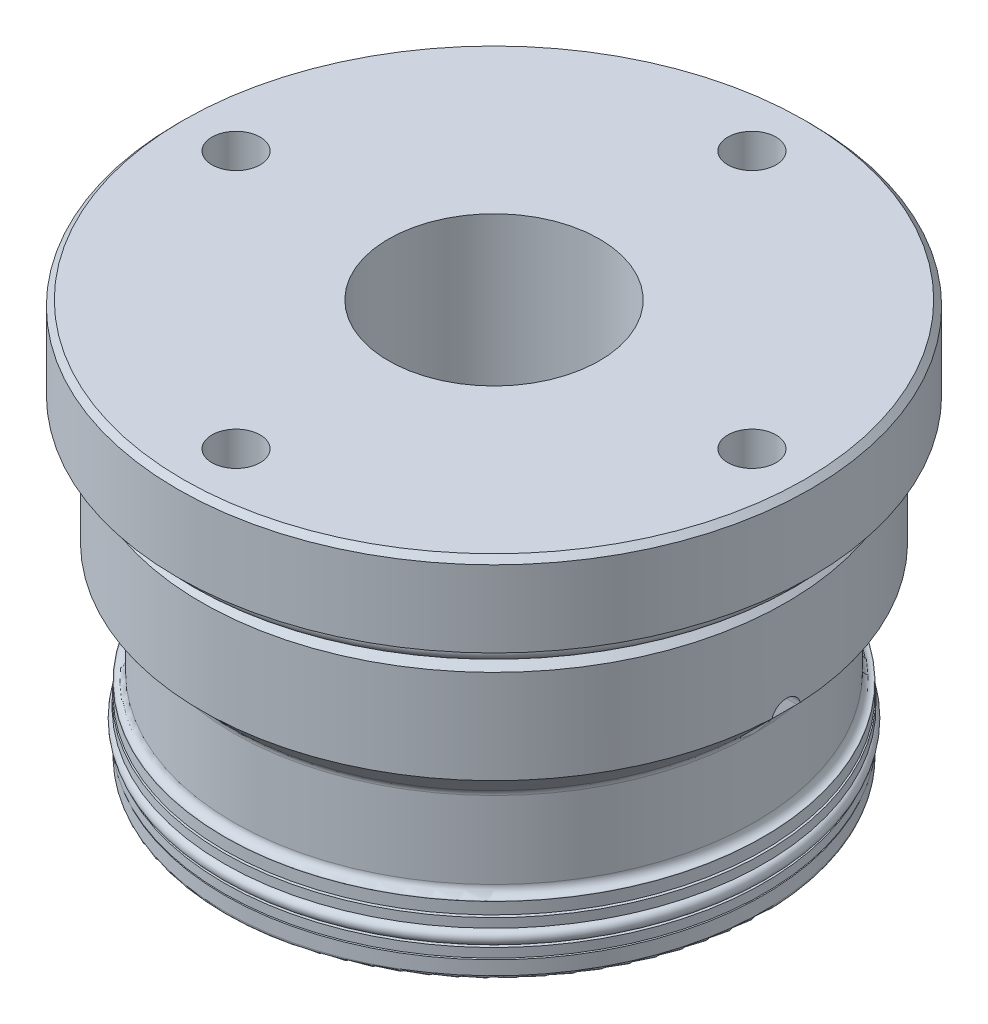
ISO-10303-21;
HEADER;
FILE_DESCRIPTION(('STEP AP214'),'2;1');
FILE_NAME('part.step','',(''),(''),'','','');
FILE_SCHEMA(('AUTOMOTIVE_DESIGN { 1 0 10303 214 1 1 1 1 }'));
ENDSEC;
DATA;
#1=APPLICATION_CONTEXT('core data for automotive mechanical design processes');
#2=APPLICATION_PROTOCOL_DEFINITION('international standard','automotive_design',2000,#1);
#3=PRODUCT_CONTEXT('',#1,'mechanical');
#4=PRODUCT('Part','Part','',(#3));
#5=PRODUCT_RELATED_PRODUCT_CATEGORY('part','',(#4));
#6=PRODUCT_DEFINITION_FORMATION('','',#4);
#7=PRODUCT_DEFINITION_CONTEXT('part definition',#1,'design');
#8=PRODUCT_DEFINITION('design','',#6,#7);
#9=PRODUCT_DEFINITION_SHAPE('','',#8);
#10=(LENGTH_UNIT() NAMED_UNIT(*) SI_UNIT(.MILLI.,.METRE.));
#11=(NAMED_UNIT(*) PLANE_ANGLE_UNIT() SI_UNIT($,.RADIAN.));
#12=(NAMED_UNIT(*) SI_UNIT($,.STERADIAN.) SOLID_ANGLE_UNIT());
#13=UNCERTAINTY_MEASURE_WITH_UNIT(LENGTH_MEASURE(1.E-05),#10,'distance_accuracy_value','');
#14=(GEOMETRIC_REPRESENTATION_CONTEXT(3) GLOBAL_UNCERTAINTY_ASSIGNED_CONTEXT((#13)) GLOBAL_UNIT_ASSIGNED_CONTEXT((#10,
#11,#12)) REPRESENTATION_CONTEXT('',''));
#15=CARTESIAN_POINT('',(0.,0.,0.));
#16=DIRECTION('',(0.,0.,1.));
#17=DIRECTION('',(1.,0.,0.));
#18=AXIS2_PLACEMENT_3D('',#15,#16,#17);
#19=CARTESIAN_POINT('',(0.,25.5905,0.));
#20=DIRECTION('',(0.,1.,0.));
#21=DIRECTION('',(0.,0.,1.));
#22=AXIS2_PLACEMENT_3D('',#19,#20,#21);
#23=CONICAL_SURFACE('',#22,39.5986,0.78539816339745);
#24=CARTESIAN_POINT('',(-39.8071781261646,25.84089,1.82498593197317));
#25=CARTESIAN_POINT('',(-39.7332630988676,25.7684559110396,1.85555950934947));
#26=CARTESIAN_POINT('',(-39.6585044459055,25.6950059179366,1.88154403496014));
#27=CARTESIAN_POINT('',(-39.5078992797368,25.5466365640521,1.92451903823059));
#28=CARTESIAN_POINT('',(-39.4320530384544,25.4717175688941,1.94151172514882));
#29=CARTESIAN_POINT('',(-39.2792645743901,25.3203712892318,1.9667963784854));
#30=CARTESIAN_POINT('',(-39.2023183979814,25.2439369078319,1.97502215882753));
#31=CARTESIAN_POINT('',(-39.0484562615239,25.0906533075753,1.98257718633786));
#32=CARTESIAN_POINT('',(-38.9715403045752,25.0138040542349,1.981905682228));
#33=CARTESIAN_POINT('',(-38.7406554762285,24.7824239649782,1.96635616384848));
#34=CARTESIAN_POINT('',(-38.5872971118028,24.6278009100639,1.93781917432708));
#35=CARTESIAN_POINT('',(-38.3628934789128,24.4001584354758,1.86628947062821));
#36=CARTESIAN_POINT('',(-38.2890949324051,24.3250584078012,1.83769734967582));
#37=CARTESIAN_POINT('',(-38.1440107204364,24.1769655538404,1.77048203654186));
#38=CARTESIAN_POINT('',(-38.0727236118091,24.103971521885,1.73186471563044));
#39=CARTESIAN_POINT('',(-37.9158132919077,23.9428211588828,1.6328393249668));
#40=CARTESIAN_POINT('',(-37.8311705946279,23.8555456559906,1.56938563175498));
#41=CARTESIAN_POINT('',(-37.6698930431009,23.6886617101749,1.42470035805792));
#42=CARTESIAN_POINT('',(-37.5932465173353,23.6090421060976,1.34349524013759));
#43=CARTESIAN_POINT('',(-37.4672091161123,23.4777071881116,1.18264573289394));
#44=CARTESIAN_POINT('',(-37.4155445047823,23.4237206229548,1.10665479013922));
#45=CARTESIAN_POINT('',(-37.3214141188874,23.3251553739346,0.943614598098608));
#46=CARTESIAN_POINT('',(-37.2789374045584,23.2805655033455,0.856578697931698));
#47=CARTESIAN_POINT('',(-37.2121776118,23.2103762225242,0.688805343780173));
#48=CARTESIAN_POINT('',(-37.1860096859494,23.1828172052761,0.609644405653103));
#49=CARTESIAN_POINT('',(-37.1431229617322,23.137612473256,0.446078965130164));
#50=CARTESIAN_POINT('',(-37.1263981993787,23.1199605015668,0.361677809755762));
#51=CARTESIAN_POINT('',(-37.1034731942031,23.0957569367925,0.189466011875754));
#52=CARTESIAN_POINT('',(-37.0973211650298,23.089256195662,0.101641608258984));
#53=CARTESIAN_POINT('',(-37.0961690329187,23.0880390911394,-0.0741621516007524));
#54=CARTESIAN_POINT('',(-37.1011678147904,23.0933215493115,-0.162141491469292));
#55=CARTESIAN_POINT('',(-37.1211450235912,23.1144152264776,-0.328883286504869));
#56=CARTESIAN_POINT('',(-37.1353552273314,23.1294159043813,-0.407845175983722));
#57=CARTESIAN_POINT('',(-37.1721253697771,23.1681873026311,-0.561522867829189));
#58=CARTESIAN_POINT('',(-37.1946865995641,23.1919593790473,-0.636238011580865));
#59=CARTESIAN_POINT('',(-37.2488694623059,23.2489655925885,-0.785186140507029));
#60=CARTESIAN_POINT('',(-37.2810171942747,23.2827481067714,-0.85901476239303));
#61=CARTESIAN_POINT('',(-37.3521207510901,23.3573256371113,-0.999460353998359));
#62=CARTESIAN_POINT('',(-37.3910808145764,23.3981250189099,-1.06607279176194));
#63=CARTESIAN_POINT('',(-37.4969674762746,23.5087728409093,-1.22563904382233));
#64=CARTESIAN_POINT('',(-37.5676584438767,23.5824353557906,-1.3134681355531));
#65=CARTESIAN_POINT('',(-37.7181738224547,23.7386952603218,-1.47164304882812));
#66=CARTESIAN_POINT('',(-37.7980195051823,23.8213134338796,-1.54194689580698));
#67=CARTESIAN_POINT('',(-37.9939775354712,24.0232892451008,-1.68838682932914));
#68=CARTESIAN_POINT('',(-38.1127781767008,24.1451446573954,-1.7574696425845));
#69=CARTESIAN_POINT('',(-38.3571748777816,24.3944808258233,-1.86754006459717));
#70=CARTESIAN_POINT('',(-38.4827792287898,24.5219684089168,-1.90849252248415));
#71=CARTESIAN_POINT('',(-38.7405666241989,24.782255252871,-1.9648484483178));
#72=CARTESIAN_POINT('',(-38.8728354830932,24.9151080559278,-1.97959935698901));
#73=CARTESIAN_POINT('',(-39.1380255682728,25.1801065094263,-1.98255204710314));
#74=CARTESIAN_POINT('',(-39.2709455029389,25.3122529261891,-1.97079400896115));
#75=CARTESIAN_POINT('',(-39.4710668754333,25.5102596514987,-1.93284033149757));
#76=CARTESIAN_POINT('',(-39.5390233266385,25.5773291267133,-1.9163521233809));
#77=CARTESIAN_POINT('',(-39.6739335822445,25.7101624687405,-1.87613501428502));
#78=CARTESIAN_POINT('',(-39.7408882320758,25.775927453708,-1.85241262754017));
#79=CARTESIAN_POINT('',(-39.8071781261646,25.84089,-1.82498593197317));
#80=B_SPLINE_CURVE_WITH_KNOTS('',3,(#24,#25,#26,#27,#28,#29,#30,#31,#32,#33,#34,#35,#36,#37,#38,
#39,#40,#41,#42,#43,#44,#45,#46,#47,#48,#49,#50,#51,#52,#53,#54,#55,#56,#57,#58,#59,#60,#61,#62,
#63,#64,#65,#66,#67,#68,#69,#70,#71,#72,#73,#74,#75,#76,#77,#78,#79),.UNSPECIFIED.,.F.,.F.,(4,2,
2,2,2,2,2,2,2,2,2,2,2,2,2,2,2,2,2,2,2,2,2,2,2,2,2,4),(0.,0.323566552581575,0.647053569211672,
0.972965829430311,1.29890560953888,1.95392792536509,2.28085310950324,2.60758725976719,
3.01765013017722,3.42710582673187,3.74568829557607,4.06388932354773,4.32623077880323,
4.58840636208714,4.85177437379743,5.11511604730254,5.35891256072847,5.60274678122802,
5.8637495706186,6.12491533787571,6.52667933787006,6.92939654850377,7.47746458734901,
8.0262162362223,8.58845266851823,9.14983747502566,9.44026825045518,9.7304382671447),.UNSPECIFIED.);
#81=CARTESIAN_POINT('',(-39.5524347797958,25.5905,1.91155040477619));
#82=VERTEX_POINT('',#81);
#83=CARTESIAN_POINT('',(-39.0276455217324,25.0698,1.9812));
#84=VERTEX_POINT('',#83);
#85=EDGE_CURVE('E191',#82,#84,#80,.T.);
#86=ORIENTED_EDGE('',*,*,#85,.T.);
#87=CARTESIAN_POINT('',(-46.1880058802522,32.2223774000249,1.9812));
#88=CARTESIAN_POINT('',(-44.9612532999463,30.9967547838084,1.9812));
#89=CARTESIAN_POINT('',(-43.7344588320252,29.771174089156,1.9812));
#90=CARTESIAN_POINT('',(-41.280754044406,27.3201287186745,1.9812));
#91=CARTESIAN_POINT('',(-40.0538437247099,26.0946640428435,1.9812));
#92=CARTESIAN_POINT('',(-37.5998751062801,23.6438828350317,1.9812));
#93=CARTESIAN_POINT('',(-36.3728168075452,22.4185663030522,1.9812));
#94=CARTESIAN_POINT('',(-33.9184946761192,19.9681390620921,1.9812));
#95=CARTESIAN_POINT('',(-32.6912308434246,18.7430283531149,1.9812));
#96=CARTESIAN_POINT('',(-31.4638354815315,17.518049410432,1.9812));
#97=B_SPLINE_CURVE_WITH_KNOTS('',3,(#87,#88,#89,#90,#91,#92,#93,#94,#95,#96),.UNSPECIFIED.,.F.,
.F.,(4,2,2,2,4),(0.,5.20227395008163,10.4045478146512,15.6068217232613,20.8090957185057),.UNSPECIFIED.);
#98=CARTESIAN_POINT('',(-35.5602294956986,21.6072769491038,1.9812));
#99=VERTEX_POINT('',#98);
#100=EDGE_CURVE('E272',#84,#99,#97,.T.);
#101=ORIENTED_EDGE('',*,*,#100,.T.);
#102=CARTESIAN_POINT('',(0.,21.6072769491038,0.));
#103=DIRECTION('',(0.,1.,0.));
#104=DIRECTION('',(0.,0.,1.));
#105=AXIS2_PLACEMENT_3D('',#102,#103,#104);
#106=CIRCLE('',#105,35.6153769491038);
#107=CARTESIAN_POINT('',(35.5602294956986,21.6072769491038,1.9812));
#108=VERTEX_POINT('',#107);
#109=EDGE_CURVE('E338',#99,#108,#106,.T.);
#110=ORIENTED_EDGE('',*,*,#109,.T.);
#111=CARTESIAN_POINT('',(43.2686628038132,29.3058969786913,1.9812));
#112=CARTESIAN_POINT('',(42.0418311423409,28.0803535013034,1.9812));
#113=CARTESIAN_POINT('',(40.8149490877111,26.8548604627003,1.9812));
#114=CARTESIAN_POINT('',(38.3610414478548,24.4040181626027,1.9812));
#115=CARTESIAN_POINT('',(37.134015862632,23.1786689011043,1.9812));
#116=CARTESIAN_POINT('',(34.6797783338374,20.7281569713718,1.9812));
#117=CARTESIAN_POINT('',(33.4525663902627,19.5029943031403,1.9812));
#118=CARTESIAN_POINT('',(30.9978754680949,17.0529364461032,1.9812));
#119=CARTESIAN_POINT('',(29.7703964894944,15.8280412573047,1.9812));
#120=CARTESIAN_POINT('',(28.5427436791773,14.6033202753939,1.9812));
#121=B_SPLINE_CURVE_WITH_KNOTS('',3,(#111,#112,#113,#114,#115,#116,#117,#118,#119,#120),
.UNSPECIFIED.,.F.,.F.,(4,2,2,2,4),(0.,5.20227399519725,10.4045478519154,15.606821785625,
20.8090958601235),.UNSPECIFIED.);
#122=CARTESIAN_POINT('',(39.0276455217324,25.0698,1.9812));
#123=VERTEX_POINT('',#122);
#124=EDGE_CURVE('E233',#123,#108,#121,.T.);
#125=ORIENTED_EDGE('',*,*,#124,.F.);
#126=CARTESIAN_POINT('',(39.8071781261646,25.84089,-1.82498593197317));
#127=CARTESIAN_POINT('',(39.7332630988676,25.7684559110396,-1.85555950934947));
#128=CARTESIAN_POINT('',(39.6585044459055,25.6950059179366,-1.88154403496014));
#129=CARTESIAN_POINT('',(39.5078992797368,25.5466365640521,-1.92451903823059));
#130=CARTESIAN_POINT('',(39.4320530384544,25.4717175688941,-1.94151172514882));
#131=CARTESIAN_POINT('',(39.2792645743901,25.3203712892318,-1.9667963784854));
#132=CARTESIAN_POINT('',(39.2023183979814,25.2439369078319,-1.97502215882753));
#133=CARTESIAN_POINT('',(39.0484562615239,25.0906533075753,-1.98257718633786));
#134=CARTESIAN_POINT('',(38.9715403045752,25.0138040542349,-1.981905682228));
#135=CARTESIAN_POINT('',(38.7406554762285,24.7824239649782,-1.96635616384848));
#136=CARTESIAN_POINT('',(38.5872971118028,24.6278009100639,-1.93781917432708));
#137=CARTESIAN_POINT('',(38.3628934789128,24.4001584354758,-1.86628947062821));
#138=CARTESIAN_POINT('',(38.2890949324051,24.3250584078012,-1.83769734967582));
#139=CARTESIAN_POINT('',(38.1440107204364,24.1769655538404,-1.77048203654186));
#140=CARTESIAN_POINT('',(38.0727236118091,24.103971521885,-1.73186471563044));
#141=CARTESIAN_POINT('',(37.9158132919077,23.9428211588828,-1.6328393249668));
#142=CARTESIAN_POINT('',(37.8311705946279,23.8555456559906,-1.56938563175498));
#143=CARTESIAN_POINT('',(37.6698930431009,23.6886617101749,-1.42470035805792));
#144=CARTESIAN_POINT('',(37.5932465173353,23.6090421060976,-1.34349524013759));
#145=CARTESIAN_POINT('',(37.4672091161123,23.4777071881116,-1.18264573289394));
#146=CARTESIAN_POINT('',(37.4155445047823,23.4237206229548,-1.10665479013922));
#147=CARTESIAN_POINT('',(37.3214141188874,23.3251553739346,-0.943614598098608));
#148=CARTESIAN_POINT('',(37.2789374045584,23.2805655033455,-0.856578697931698));
#149=CARTESIAN_POINT('',(37.2121776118,23.2103762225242,-0.688805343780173));
#150=CARTESIAN_POINT('',(37.1860096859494,23.1828172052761,-0.609644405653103));
#151=CARTESIAN_POINT('',(37.1431229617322,23.137612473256,-0.446078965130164));
#152=CARTESIAN_POINT('',(37.1263981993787,23.1199605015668,-0.361677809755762));
#153=CARTESIAN_POINT('',(37.1034731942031,23.0957569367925,-0.189466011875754));
#154=CARTESIAN_POINT('',(37.0973211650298,23.089256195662,-0.101641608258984));
#155=CARTESIAN_POINT('',(37.0961690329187,23.0880390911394,0.0741621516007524));
#156=CARTESIAN_POINT('',(37.1011678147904,23.0933215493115,0.162141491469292));
#157=CARTESIAN_POINT('',(37.1211450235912,23.1144152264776,0.328883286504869));
#158=CARTESIAN_POINT('',(37.1353552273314,23.1294159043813,0.407845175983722));
#159=CARTESIAN_POINT('',(37.1721253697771,23.1681873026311,0.561522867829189));
#160=CARTESIAN_POINT('',(37.1946865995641,23.1919593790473,0.636238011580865));
#161=CARTESIAN_POINT('',(37.2488694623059,23.2489655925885,0.785186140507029));
#162=CARTESIAN_POINT('',(37.2810171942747,23.2827481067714,0.85901476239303));
#163=CARTESIAN_POINT('',(37.3521207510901,23.3573256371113,0.999460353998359));
#164=CARTESIAN_POINT('',(37.3910808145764,23.3981250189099,1.06607279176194));
#165=CARTESIAN_POINT('',(37.4969674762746,23.5087728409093,1.22563904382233));
#166=CARTESIAN_POINT('',(37.5676584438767,23.5824353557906,1.3134681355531));
#167=CARTESIAN_POINT('',(37.7181738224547,23.7386952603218,1.47164304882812));
#168=CARTESIAN_POINT('',(37.7980195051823,23.8213134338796,1.54194689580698));
#169=CARTESIAN_POINT('',(37.9939775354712,24.0232892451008,1.68838682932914));
#170=CARTESIAN_POINT('',(38.1127781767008,24.1451446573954,1.7574696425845));
#171=CARTESIAN_POINT('',(38.3571748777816,24.3944808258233,1.86754006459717));
#172=CARTESIAN_POINT('',(38.4827792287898,24.5219684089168,1.90849252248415));
#173=CARTESIAN_POINT('',(38.7405666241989,24.782255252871,1.9648484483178));
#174=CARTESIAN_POINT('',(38.8728354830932,24.9151080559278,1.97959935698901));
#175=CARTESIAN_POINT('',(39.1380255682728,25.1801065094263,1.98255204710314));
#176=CARTESIAN_POINT('',(39.2709455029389,25.3122529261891,1.97079400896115));
#177=CARTESIAN_POINT('',(39.4710668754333,25.5102596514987,1.93284033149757));
#178=CARTESIAN_POINT('',(39.5390233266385,25.5773291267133,1.9163521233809));
#179=CARTESIAN_POINT('',(39.6739335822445,25.7101624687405,1.87613501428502));
#180=CARTESIAN_POINT('',(39.7408882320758,25.775927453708,1.85241262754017));
#181=CARTESIAN_POINT('',(39.8071781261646,25.84089,1.82498593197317));
#182=B_SPLINE_CURVE_WITH_KNOTS('',3,(#126,#127,#128,#129,#130,#131,#132,#133,#134,#135,#136,
#137,#138,#139,#140,#141,#142,#143,#144,#145,#146,#147,#148,#149,#150,#151,#152,#153,#154,#155,
#156,#157,#158,#159,#160,#161,#162,#163,#164,#165,#166,#167,#168,#169,#170,#171,#172,#173,#174,
#175,#176,#177,#178,#179,#180,#181),.UNSPECIFIED.,.F.,.F.,(4,2,2,2,2,2,2,2,2,2,2,2,2,2,2,2,2,2,
2,2,2,2,2,2,2,2,2,4),(0.,0.323566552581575,0.647053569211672,0.972965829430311,1.29890560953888,
1.95392792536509,2.28085310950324,2.60758725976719,3.01765013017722,3.42710582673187,
3.74568829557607,4.06388932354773,4.32623077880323,4.58840636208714,4.85177437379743,
5.11511604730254,5.35891256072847,5.60274678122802,5.8637495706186,6.12491533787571,
6.52667933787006,6.92939654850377,7.47746458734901,8.0262162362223,8.58845266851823,
9.14983747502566,9.44026825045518,9.7304382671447),.UNSPECIFIED.);
#183=CARTESIAN_POINT('',(39.5524347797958,25.5905,1.91155040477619));
#184=VERTEX_POINT('',#183);
#185=EDGE_CURVE('E210',#123,#184,#182,.T.);
#186=ORIENTED_EDGE('',*,*,#185,.T.);
#187=CARTESIAN_POINT('',(0.,25.5905,0.));
#188=DIRECTION('',(0.,-1.,0.));
#189=DIRECTION('',(0.,0.,-1.));
#190=AXIS2_PLACEMENT_3D('',#187,#188,#189);
#191=CIRCLE('',#190,39.5986);
#192=EDGE_CURVE('E424',#184,#82,#191,.T.);
#193=ORIENTED_EDGE('',*,*,#192,.T.);
#194=EDGE_LOOP('',(#86,#101,#110,#125,#186,#193));
#195=FACE_BOUND('',#194,.T.);
#196=ADVANCED_FACE('F33',(#195),#23,.T.);
#197=CARTESIAN_POINT('',(0.,20.7990538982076,0.));
#198=DIRECTION('',(0.,-1.,0.));
#199=DIRECTION('',(0.,0.,-1.));
#200=AXIS2_PLACEMENT_3D('',#197,#198,#199);
#201=TOROIDAL_SURFACE('',#200,36.4236,1.143);
#202=ORIENTED_EDGE('',*,*,#109,.F.);
#203=CARTESIAN_POINT('',(-35.2738136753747,21.1294980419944,1.9812));
#204=CARTESIAN_POINT('',(-35.2552554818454,21.0681336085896,1.9812));
#205=CARTESIAN_POINT('',(-35.241864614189,21.0051578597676,1.9812));
#206=CARTESIAN_POINT('',(-35.2258368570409,20.8777997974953,1.9812));
#207=CARTESIAN_POINT('',(-35.2232128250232,20.8134158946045,1.9812));
#208=CARTESIAN_POINT('',(-35.2288158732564,20.6851465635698,1.9812));
#209=CARTESIAN_POINT('',(-35.2370378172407,20.6212609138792,1.9812));
#210=CARTESIAN_POINT('',(-35.2640879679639,20.4957941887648,1.9812));
#211=CARTESIAN_POINT('',(-35.2829135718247,20.4342125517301,1.9812));
#212=CARTESIAN_POINT('',(-35.3306345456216,20.3150680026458,1.9812));
#213=CARTESIAN_POINT('',(-35.3595320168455,20.2575059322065,1.9812));
#214=CARTESIAN_POINT('',(-35.4265720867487,20.1480413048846,1.9812));
#215=CARTESIAN_POINT('',(-35.4647150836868,20.0961389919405,1.9812));
#216=CARTESIAN_POINT('',(-35.5492030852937,19.9994105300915,1.9812));
#217=CARTESIAN_POINT('',(-35.5955565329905,19.9545917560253,1.9812));
#218=CARTESIAN_POINT('',(-35.6951199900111,19.8733583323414,1.9812));
#219=CARTESIAN_POINT('',(-35.7483300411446,19.8369437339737,1.9812));
#220=CARTESIAN_POINT('',(-35.8601821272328,19.7734943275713,1.9812));
#221=CARTESIAN_POINT('',(-35.9188322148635,19.7464737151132,1.9812));
#222=CARTESIAN_POINT('',(-36.0398324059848,19.7026484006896,1.9812));
#223=CARTESIAN_POINT('',(-36.1021825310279,19.685843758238,1.9812));
#224=CARTESIAN_POINT('',(-36.2288972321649,19.6629080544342,1.9812));
#225=CARTESIAN_POINT('',(-36.2932642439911,19.6567904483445,1.9812));
#226=CARTESIAN_POINT('',(-36.422112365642,19.6554427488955,1.9812));
#227=CARTESIAN_POINT('',(-36.4865934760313,19.6602127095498,1.9812));
#228=CARTESIAN_POINT('',(-36.6138704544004,19.6805114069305,1.9812));
#229=CARTESIAN_POINT('',(-36.6766655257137,19.6960451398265,1.9812));
#230=CARTESIAN_POINT('',(-36.7987544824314,19.7374396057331,1.9812));
#231=CARTESIAN_POINT('',(-36.8580483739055,19.76330032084,1.9812));
#232=CARTESIAN_POINT('',(-36.9714187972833,19.8246039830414,1.9812));
#233=CARTESIAN_POINT('',(-37.0254978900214,19.8600421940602,1.9812));
#234=CARTESIAN_POINT('',(-37.1269297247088,19.9395049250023,1.9812));
#235=CARTESIAN_POINT('',(-37.1742825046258,19.9835293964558,1.9812));
#236=CARTESIAN_POINT('',(-37.2608559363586,20.0788592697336,1.9812));
#237=CARTESIAN_POINT('',(-37.3000862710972,20.1301558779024,1.9812));
#238=CARTESIAN_POINT('',(-37.3693640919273,20.2386147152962,1.9812));
#239=CARTESIAN_POINT('',(-37.3994116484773,20.2957768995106,1.9812));
#240=CARTESIAN_POINT('',(-37.449428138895,20.4142596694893,1.9812));
#241=CARTESIAN_POINT('',(-37.4694108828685,20.4755744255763,1.9812));
#242=CARTESIAN_POINT('',(-37.4987874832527,20.6006901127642,1.9812));
#243=CARTESIAN_POINT('',(-37.5081814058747,20.6644910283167,1.9812));
#244=CARTESIAN_POINT('',(-37.5161072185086,20.7927008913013,1.9812));
#245=CARTESIAN_POINT('',(-37.5146497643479,20.8571091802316,1.9812));
#246=CARTESIAN_POINT('',(-37.5009398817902,20.9847662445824,1.9812));
#247=CARTESIAN_POINT('',(-37.4886874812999,21.048015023,1.9812));
#248=CARTESIAN_POINT('',(-37.4537418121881,21.1715456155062,1.9812));
#249=CARTESIAN_POINT('',(-37.4310505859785,21.2318280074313,1.9812));
#250=CARTESIAN_POINT('',(-37.3758761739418,21.3477312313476,1.9812));
#251=CARTESIAN_POINT('',(-37.3433929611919,21.4033520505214,1.9812));
#252=CARTESIAN_POINT('',(-37.2695358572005,21.5083946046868,1.9812));
#253=CARTESIAN_POINT('',(-37.2281560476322,21.5578121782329,1.9812));
#254=CARTESIAN_POINT('',(-37.1376967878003,21.6490096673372,1.9812));
#255=CARTESIAN_POINT('',(-37.0886172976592,21.6907895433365,1.9812));
#256=CARTESIAN_POINT('',(-36.9840859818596,21.7655827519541,1.9812));
#257=CARTESIAN_POINT('',(-36.9286261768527,21.7985849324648,1.9812));
#258=CARTESIAN_POINT('',(-36.8129587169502,21.8548245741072,1.9812));
#259=CARTESIAN_POINT('',(-36.7527510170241,21.878061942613,1.9812));
#260=CARTESIAN_POINT('',(-36.6292098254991,21.9141439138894,1.9812));
#261=CARTESIAN_POINT('',(-36.5658722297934,21.9269744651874,1.9812));
#262=CARTESIAN_POINT('',(-36.4379420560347,21.9418301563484,1.9812));
#263=CARTESIAN_POINT('',(-36.3733494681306,21.943855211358,1.9812));
#264=CARTESIAN_POINT('',(-36.2446827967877,21.9370403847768,1.9812));
#265=CARTESIAN_POINT('',(-36.1806092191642,21.9281909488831,1.9812));
#266=CARTESIAN_POINT('',(-36.0548594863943,21.899860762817,1.9812));
#267=CARTESIAN_POINT('',(-35.9931832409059,21.8803804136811,1.9812));
#268=CARTESIAN_POINT('',(-35.8739865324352,21.8313415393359,1.9812));
#269=CARTESIAN_POINT('',(-35.8164655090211,21.8017843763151,1.9812));
#270=CARTESIAN_POINT('',(-35.707193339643,21.7334147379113,1.9812));
#271=CARTESIAN_POINT('',(-35.6554436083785,21.6946000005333,1.9812));
#272=CARTESIAN_POINT('',(-35.5592347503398,21.6088459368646,1.9812));
#273=CARTESIAN_POINT('',(-35.5147721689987,21.5619104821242,1.9812));
#274=CARTESIAN_POINT('',(-35.4344171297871,21.4612652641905,1.9812));
#275=CARTESIAN_POINT('',(-35.3985143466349,21.407563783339,1.9812));
#276=CARTESIAN_POINT('',(-35.3479502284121,21.3160820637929,1.9812));
#277=CARTESIAN_POINT('',(-35.3303717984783,21.2798814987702,1.9812));
#278=CARTESIAN_POINT('',(-35.2991227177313,21.2058312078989,1.9812));
#279=CARTESIAN_POINT('',(-35.2854520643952,21.167981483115,1.9812));
#280=CARTESIAN_POINT('',(-35.2738136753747,21.1294980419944,1.9812));
#281=B_SPLINE_CURVE_WITH_KNOTS('',3,(#203,#204,#205,#206,#207,#208,#209,#210,#211,#212,#213,
#214,#215,#216,#217,#218,#219,#220,#221,#222,#223,#224,#225,#226,#227,#228,#229,#230,#231,#232,
#233,#234,#235,#236,#237,#238,#239,#240,#241,#242,#243,#244,#245,#246,#247,#248,#249,#250,#251,
#252,#253,#254,#255,#256,#257,#258,#259,#260,#261,#262,#263,#264,#265,#266,#267,#268,#269,#270,
#271,#272,#273,#274,#275,#276,#277,#278,#279,#280),.UNSPECIFIED.,.T.,.F.,(4,2,2,2,2,2,2,2,2,2,2,
2,2,2,2,2,2,2,2,2,2,2,2,2,2,2,2,2,2,2,2,2,2,2,2,2,2,2,4),(0.,0.19218115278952,0.384591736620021,
0.576911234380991,0.769183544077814,0.961495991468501,1.15381672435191,1.3463363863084,
1.53885722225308,1.73166773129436,1.92447936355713,2.11753357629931,2.3105887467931,
2.50373358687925,2.69687809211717,2.88992726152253,3.0829753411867,3.27579194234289,
3.46860706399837,3.66115689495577,3.85370552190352,4.04606509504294,4.2384241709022,
4.4307456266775,4.62306761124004,4.81551793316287,5.00796925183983,5.20066392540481,
5.39336042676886,5.58631667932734,5.7792744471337,5.97240186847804,6.16552200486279,
6.35861604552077,6.55175731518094,6.74480675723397,6.93762214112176,7.05814467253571,
7.17866712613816),.UNSPECIFIED.);
#282=CARTESIAN_POINT('',(-35.2806,21.1511549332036,1.9812));
#283=VERTEX_POINT('',#282);
#284=EDGE_CURVE('E251',#99,#283,#281,.T.);
#285=ORIENTED_EDGE('',*,*,#284,.T.);
#286=CARTESIAN_POINT('',(-35.2806,20.7990538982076,0.));
#287=CARTESIAN_POINT('',(-35.2806,20.8012721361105,0.0123240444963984));
#288=CARTESIAN_POINT('',(-35.2806,20.803490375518,0.0246480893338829));
#289=CARTESIAN_POINT('',(-35.2806000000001,20.8732044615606,0.411968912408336));
#290=CARTESIAN_POINT('',(-35.2806,20.9406754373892,0.78697067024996));
#291=CARTESIAN_POINT('',(-35.2806,21.0406382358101,1.34965811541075));
#292=CARTESIAN_POINT('',(-35.2806,21.0737487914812,1.53723349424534));
#293=CARTESIAN_POINT('',(-35.2806,21.1393573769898,1.91252496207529));
#294=CARTESIAN_POINT('',(-35.2806,21.171855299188,2.10024106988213));
#295=CARTESIAN_POINT('',(-35.2806,21.2623128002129,2.62969235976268));
#296=CARTESIAN_POINT('',(-35.2806,21.3193155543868,2.97159251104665));
#297=CARTESIAN_POINT('',(-35.2806,21.4292238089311,3.65604447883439));
#298=CARTESIAN_POINT('',(-35.2806,21.4821294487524,3.99859627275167));
#299=CARTESIAN_POINT('',(-35.2806,21.5822825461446,4.68421844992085));
#300=CARTESIAN_POINT('',(-35.2806,21.6295350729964,5.02728808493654));
#301=CARTESIAN_POINT('',(-35.2806,21.7166814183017,5.71443493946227));
#302=CARTESIAN_POINT('',(-35.2806,21.7565739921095,6.05851231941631));
#303=CARTESIAN_POINT('',(-35.2806,21.8270053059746,6.74941109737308));
#304=CARTESIAN_POINT('',(-35.2806,21.8574953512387,7.0962375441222));
#305=CARTESIAN_POINT('',(-35.2806,21.9060131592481,7.79065263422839));
#306=CARTESIAN_POINT('',(-35.2806,21.9240469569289,8.13824082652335));
#307=CARTESIAN_POINT('',(-35.2806,21.9387588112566,8.66068683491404));
#308=CARTESIAN_POINT('',(-35.2806,21.9415993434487,8.83537284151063));
#309=CARTESIAN_POINT('',(-35.2806,21.9424089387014,9.18473808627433));
#310=CARTESIAN_POINT('',(-35.2806,21.9403787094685,9.35941732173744));
#311=CARTESIAN_POINT('',(-35.2806,21.9305515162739,9.70891863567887));
#312=CARTESIAN_POINT('',(-35.2806,21.9227450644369,9.88374047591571));
#313=CARTESIAN_POINT('',(-35.2806,21.9057781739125,10.1456741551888));
#314=CARTESIAN_POINT('',(-35.2806,21.899244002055,10.2329577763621));
#315=CARTESIAN_POINT('',(-35.2806,21.8842096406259,10.4073644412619));
#316=CARTESIAN_POINT('',(-35.2806,21.8757092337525,10.4944874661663));
#317=CARTESIAN_POINT('',(-35.2806,21.86612000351,10.5814975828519));
#318=B_SPLINE_CURVE_WITH_KNOTS('',3,(#286,#287,#288,#289,#290,#291,#292,#293,#294,#295,#296,
#297,#298,#299,#300,#301,#302,#303,#304,#305,#306,#307,#308,#309,#310,#311,#312,#313,#314,#315,
#316,#317),.UNSPECIFIED.,.F.,.F.,(4,2,2,2,2,2,2,2,2,2,2,2,2,2,2,4),(0.,0.0375662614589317,
1.18063421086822,1.7520591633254,2.32358359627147,3.36342480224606,4.40323060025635,
5.44209687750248,6.48113867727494,7.52547454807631,8.56930409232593,9.09337708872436,
9.61737394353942,10.1422334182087,10.4047972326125,10.667390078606),.UNSPECIFIED.);
#319=CARTESIAN_POINT('',(-35.2806,20.7990538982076,0.));
#320=VERTEX_POINT('',#319);
#321=EDGE_CURVE('E318',#320,#283,#318,.T.);
#322=ORIENTED_EDGE('',*,*,#321,.F.);
#323=CARTESIAN_POINT('',(0.,20.7990538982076,0.));
#324=DIRECTION('',(0.,-1.,0.));
#325=DIRECTION('',(0.,0.,-1.));
#326=AXIS2_PLACEMENT_3D('',#323,#324,#325);
#327=CIRCLE('',#326,35.2806);
#328=CARTESIAN_POINT('',(35.2806,20.7990538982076,0.));
#329=VERTEX_POINT('',#328);
#330=EDGE_CURVE('E330',#329,#320,#327,.T.);
#331=ORIENTED_EDGE('',*,*,#330,.F.);
#332=CARTESIAN_POINT('',(35.2806,20.7990538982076,0.));
#333=CARTESIAN_POINT('',(35.2806,20.8012721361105,0.0123240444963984));
#334=CARTESIAN_POINT('',(35.2806,20.803490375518,0.0246480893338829));
#335=CARTESIAN_POINT('',(35.2806000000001,20.8732044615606,0.411968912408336));
#336=CARTESIAN_POINT('',(35.2806,20.9406754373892,0.78697067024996));
#337=CARTESIAN_POINT('',(35.2806,21.0406382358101,1.34965811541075));
#338=CARTESIAN_POINT('',(35.2806,21.0737487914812,1.53723349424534));
#339=CARTESIAN_POINT('',(35.2806,21.1393573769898,1.91252496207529));
#340=CARTESIAN_POINT('',(35.2806,21.171855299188,2.10024106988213));
#341=CARTESIAN_POINT('',(35.2806,21.2623128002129,2.62969235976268));
#342=CARTESIAN_POINT('',(35.2806,21.3193155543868,2.97159251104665));
#343=CARTESIAN_POINT('',(35.2806,21.4292238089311,3.65604447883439));
#344=CARTESIAN_POINT('',(35.2806,21.4821294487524,3.99859627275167));
#345=CARTESIAN_POINT('',(35.2806,21.5822825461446,4.68421844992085));
#346=CARTESIAN_POINT('',(35.2806,21.6295350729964,5.02728808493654));
#347=CARTESIAN_POINT('',(35.2806,21.7166814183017,5.71443493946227));
#348=CARTESIAN_POINT('',(35.2806,21.7565739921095,6.05851231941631));
#349=CARTESIAN_POINT('',(35.2806,21.8270053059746,6.74941109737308));
#350=CARTESIAN_POINT('',(35.2806,21.8574953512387,7.0962375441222));
#351=CARTESIAN_POINT('',(35.2806,21.9060131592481,7.79065263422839));
#352=CARTESIAN_POINT('',(35.2806,21.9240469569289,8.13824082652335));
#353=CARTESIAN_POINT('',(35.2806,21.9387588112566,8.66068683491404));
#354=CARTESIAN_POINT('',(35.2806,21.9415993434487,8.83537284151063));
#355=CARTESIAN_POINT('',(35.2806,21.9424089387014,9.18473808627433));
#356=CARTESIAN_POINT('',(35.2806,21.9403787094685,9.35941732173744));
#357=CARTESIAN_POINT('',(35.2806,21.9305515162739,9.70891863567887));
#358=CARTESIAN_POINT('',(35.2806,21.9227450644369,9.88374047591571));
#359=CARTESIAN_POINT('',(35.2806,21.9057781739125,10.1456741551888));
#360=CARTESIAN_POINT('',(35.2806,21.899244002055,10.2329577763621));
#361=CARTESIAN_POINT('',(35.2806,21.8842096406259,10.4073644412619));
#362=CARTESIAN_POINT('',(35.2806,21.8757092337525,10.4944874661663));
#363=CARTESIAN_POINT('',(35.2806,21.86612000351,10.5814975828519));
#364=B_SPLINE_CURVE_WITH_KNOTS('',3,(#332,#333,#334,#335,#336,#337,#338,#339,#340,#341,#342,
#343,#344,#345,#346,#347,#348,#349,#350,#351,#352,#353,#354,#355,#356,#357,#358,#359,#360,#361,
#362,#363),.UNSPECIFIED.,.F.,.F.,(4,2,2,2,2,2,2,2,2,2,2,2,2,2,2,4),(0.,0.0375662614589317,
1.18063421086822,1.7520591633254,2.32358359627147,3.36342480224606,4.40323060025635,
5.44209687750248,6.48113867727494,7.52547454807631,8.56930409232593,9.09337708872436,
9.61737394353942,10.1422334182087,10.4047972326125,10.667390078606),.UNSPECIFIED.);
#365=CARTESIAN_POINT('',(35.2806,21.1511549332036,1.9812));
#366=VERTEX_POINT('',#365);
#367=EDGE_CURVE('E282',#366,#329,#364,.F.);
#368=ORIENTED_EDGE('',*,*,#367,.F.);
#369=CARTESIAN_POINT('',(35.2738136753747,21.1294980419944,1.9812));
#370=CARTESIAN_POINT('',(35.2552554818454,21.0681336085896,1.9812));
#371=CARTESIAN_POINT('',(35.241864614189,21.0051578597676,1.9812));
#372=CARTESIAN_POINT('',(35.2258368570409,20.8777997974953,1.9812));
#373=CARTESIAN_POINT('',(35.2232128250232,20.8134158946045,1.9812));
#374=CARTESIAN_POINT('',(35.2288158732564,20.6851465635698,1.9812));
#375=CARTESIAN_POINT('',(35.2370378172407,20.6212609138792,1.9812));
#376=CARTESIAN_POINT('',(35.2640879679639,20.4957941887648,1.9812));
#377=CARTESIAN_POINT('',(35.2829135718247,20.4342125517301,1.9812));
#378=CARTESIAN_POINT('',(35.3306345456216,20.3150680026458,1.9812));
#379=CARTESIAN_POINT('',(35.3595320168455,20.2575059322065,1.9812));
#380=CARTESIAN_POINT('',(35.4265720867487,20.1480413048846,1.9812));
#381=CARTESIAN_POINT('',(35.4647150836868,20.0961389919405,1.9812));
#382=CARTESIAN_POINT('',(35.5492030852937,19.9994105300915,1.9812));
#383=CARTESIAN_POINT('',(35.5955565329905,19.9545917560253,1.9812));
#384=CARTESIAN_POINT('',(35.6951199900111,19.8733583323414,1.9812));
#385=CARTESIAN_POINT('',(35.7483300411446,19.8369437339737,1.9812));
#386=CARTESIAN_POINT('',(35.8601821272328,19.7734943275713,1.9812));
#387=CARTESIAN_POINT('',(35.9188322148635,19.7464737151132,1.9812));
#388=CARTESIAN_POINT('',(36.0398324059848,19.7026484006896,1.9812));
#389=CARTESIAN_POINT('',(36.1021825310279,19.685843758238,1.9812));
#390=CARTESIAN_POINT('',(36.2288972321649,19.6629080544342,1.9812));
#391=CARTESIAN_POINT('',(36.2932642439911,19.6567904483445,1.9812));
#392=CARTESIAN_POINT('',(36.422112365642,19.6554427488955,1.9812));
#393=CARTESIAN_POINT('',(36.4865934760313,19.6602127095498,1.9812));
#394=CARTESIAN_POINT('',(36.6138704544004,19.6805114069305,1.9812));
#395=CARTESIAN_POINT('',(36.6766655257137,19.6960451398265,1.9812));
#396=CARTESIAN_POINT('',(36.7987544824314,19.7374396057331,1.9812));
#397=CARTESIAN_POINT('',(36.8580483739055,19.76330032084,1.9812));
#398=CARTESIAN_POINT('',(36.9714187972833,19.8246039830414,1.9812));
#399=CARTESIAN_POINT('',(37.0254978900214,19.8600421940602,1.9812));
#400=CARTESIAN_POINT('',(37.1269297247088,19.9395049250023,1.9812));
#401=CARTESIAN_POINT('',(37.1742825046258,19.9835293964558,1.9812));
#402=CARTESIAN_POINT('',(37.2608559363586,20.0788592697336,1.9812));
#403=CARTESIAN_POINT('',(37.3000862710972,20.1301558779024,1.9812));
#404=CARTESIAN_POINT('',(37.3693640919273,20.2386147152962,1.9812));
#405=CARTESIAN_POINT('',(37.3994116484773,20.2957768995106,1.9812));
#406=CARTESIAN_POINT('',(37.449428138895,20.4142596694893,1.9812));
#407=CARTESIAN_POINT('',(37.4694108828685,20.4755744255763,1.9812));
#408=CARTESIAN_POINT('',(37.4987874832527,20.6006901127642,1.9812));
#409=CARTESIAN_POINT('',(37.5081814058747,20.6644910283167,1.9812));
#410=CARTESIAN_POINT('',(37.5161072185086,20.7927008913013,1.9812));
#411=CARTESIAN_POINT('',(37.5146497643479,20.8571091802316,1.9812));
#412=CARTESIAN_POINT('',(37.5009398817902,20.9847662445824,1.9812));
#413=CARTESIAN_POINT('',(37.4886874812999,21.048015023,1.9812));
#414=CARTESIAN_POINT('',(37.4537418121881,21.1715456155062,1.9812));
#415=CARTESIAN_POINT('',(37.4310505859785,21.2318280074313,1.9812));
#416=CARTESIAN_POINT('',(37.3758761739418,21.3477312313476,1.9812));
#417=CARTESIAN_POINT('',(37.3433929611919,21.4033520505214,1.9812));
#418=CARTESIAN_POINT('',(37.2695358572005,21.5083946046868,1.9812));
#419=CARTESIAN_POINT('',(37.2281560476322,21.5578121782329,1.9812));
#420=CARTESIAN_POINT('',(37.1376967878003,21.6490096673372,1.9812));
#421=CARTESIAN_POINT('',(37.0886172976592,21.6907895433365,1.9812));
#422=CARTESIAN_POINT('',(36.9840859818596,21.7655827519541,1.9812));
#423=CARTESIAN_POINT('',(36.9286261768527,21.7985849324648,1.9812));
#424=CARTESIAN_POINT('',(36.8129587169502,21.8548245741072,1.9812));
#425=CARTESIAN_POINT('',(36.7527510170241,21.878061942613,1.9812));
#426=CARTESIAN_POINT('',(36.6292098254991,21.9141439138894,1.9812));
#427=CARTESIAN_POINT('',(36.5658722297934,21.9269744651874,1.9812));
#428=CARTESIAN_POINT('',(36.4379420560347,21.9418301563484,1.9812));
#429=CARTESIAN_POINT('',(36.3733494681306,21.943855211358,1.9812));
#430=CARTESIAN_POINT('',(36.2446827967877,21.9370403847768,1.9812));
#431=CARTESIAN_POINT('',(36.1806092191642,21.9281909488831,1.9812));
#432=CARTESIAN_POINT('',(36.0548594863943,21.899860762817,1.9812));
#433=CARTESIAN_POINT('',(35.9931832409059,21.8803804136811,1.9812));
#434=CARTESIAN_POINT('',(35.8739865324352,21.8313415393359,1.9812));
#435=CARTESIAN_POINT('',(35.8164655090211,21.8017843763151,1.9812));
#436=CARTESIAN_POINT('',(35.707193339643,21.7334147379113,1.9812));
#437=CARTESIAN_POINT('',(35.6554436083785,21.6946000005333,1.9812));
#438=CARTESIAN_POINT('',(35.5592347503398,21.6088459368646,1.9812));
#439=CARTESIAN_POINT('',(35.5147721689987,21.5619104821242,1.9812));
#440=CARTESIAN_POINT('',(35.4344171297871,21.4612652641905,1.9812));
#441=CARTESIAN_POINT('',(35.3985143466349,21.407563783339,1.9812));
#442=CARTESIAN_POINT('',(35.3479502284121,21.3160820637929,1.9812));
#443=CARTESIAN_POINT('',(35.3303717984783,21.2798814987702,1.9812));
#444=CARTESIAN_POINT('',(35.2991227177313,21.2058312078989,1.9812));
#445=CARTESIAN_POINT('',(35.2854520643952,21.167981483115,1.9812));
#446=CARTESIAN_POINT('',(35.2738136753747,21.1294980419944,1.9812));
#447=B_SPLINE_CURVE_WITH_KNOTS('',3,(#369,#370,#371,#372,#373,#374,#375,#376,#377,#378,#379,
#380,#381,#382,#383,#384,#385,#386,#387,#388,#389,#390,#391,#392,#393,#394,#395,#396,#397,#398,
#399,#400,#401,#402,#403,#404,#405,#406,#407,#408,#409,#410,#411,#412,#413,#414,#415,#416,#417,
#418,#419,#420,#421,#422,#423,#424,#425,#426,#427,#428,#429,#430,#431,#432,#433,#434,#435,#436,
#437,#438,#439,#440,#441,#442,#443,#444,#445,#446),.UNSPECIFIED.,.T.,.F.,(4,2,2,2,2,2,2,2,2,2,2,
2,2,2,2,2,2,2,2,2,2,2,2,2,2,2,2,2,2,2,2,2,2,2,2,2,2,2,4),(0.,0.19218115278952,0.384591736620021,
0.576911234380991,0.769183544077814,0.961495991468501,1.15381672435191,1.3463363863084,
1.53885722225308,1.73166773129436,1.92447936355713,2.11753357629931,2.3105887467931,
2.50373358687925,2.69687809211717,2.88992726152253,3.0829753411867,3.27579194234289,
3.46860706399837,3.66115689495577,3.85370552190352,4.04606509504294,4.2384241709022,
4.4307456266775,4.62306761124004,4.81551793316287,5.00796925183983,5.20066392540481,
5.39336042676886,5.58631667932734,5.7792744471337,5.97240186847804,6.16552200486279,
6.35861604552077,6.55175731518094,6.74480675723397,6.93762214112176,7.05814467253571,
7.17866712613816),.UNSPECIFIED.);
#448=EDGE_CURVE('E306',#108,#366,#447,.T.);
#449=ORIENTED_EDGE('',*,*,#448,.F.);
#450=EDGE_LOOP('',(#202,#285,#322,#331,#368,#449));
#451=FACE_BOUND('',#450,.T.);
#452=ADVANCED_FACE('F219',(#451),#201,.F.);
#453=CARTESIAN_POINT('',(35.5602294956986,21.6072769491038,-1.9812));
#454=VERTEX_POINT('',#453);
#455=CARTESIAN_POINT('',(-35.5602294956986,21.6072769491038,-1.9812));
#456=VERTEX_POINT('',#455);
#457=EDGE_CURVE('E339',#454,#456,#106,.T.);
#458=ORIENTED_EDGE('',*,*,#457,.T.);
#459=CARTESIAN_POINT('',(-31.4638354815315,17.518049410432,-1.9812));
#460=CARTESIAN_POINT('',(-32.6912308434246,18.7430283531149,-1.9812));
#461=CARTESIAN_POINT('',(-33.9184946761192,19.9681390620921,-1.9812));
#462=CARTESIAN_POINT('',(-36.3728168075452,22.4185663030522,-1.9812));
#463=CARTESIAN_POINT('',(-37.5998751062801,23.6438828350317,-1.9812));
#464=CARTESIAN_POINT('',(-40.0538437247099,26.0946640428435,-1.9812));
#465=CARTESIAN_POINT('',(-41.280754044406,27.3201287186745,-1.9812));
#466=CARTESIAN_POINT('',(-43.7344588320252,29.771174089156,-1.9812));
#467=CARTESIAN_POINT('',(-44.9612532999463,30.9967547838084,-1.9812));
#468=CARTESIAN_POINT('',(-46.1880058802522,32.2223774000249,-1.9812));
#469=B_SPLINE_CURVE_WITH_KNOTS('',3,(#459,#460,#461,#462,#463,#464,#465,#466,#467,#468),
.UNSPECIFIED.,.F.,.F.,(4,2,2,2,4),(0.,5.20227399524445,10.4045479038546,15.6068217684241,
20.8090957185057),.UNSPECIFIED.);
#470=CARTESIAN_POINT('',(-39.0276455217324,25.0698,-1.9812));
#471=VERTEX_POINT('',#470);
#472=EDGE_CURVE('E244',#456,#471,#469,.T.);
#473=ORIENTED_EDGE('',*,*,#472,.T.);
#474=CARTESIAN_POINT('',(-39.5524347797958,25.5905,-1.91155040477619));
#475=VERTEX_POINT('',#474);
#476=EDGE_CURVE('E147',#471,#475,#80,.T.);
#477=ORIENTED_EDGE('',*,*,#476,.T.);
#478=CARTESIAN_POINT('',(39.5524347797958,25.5905,-1.91155040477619));
#479=VERTEX_POINT('',#478);
#480=EDGE_CURVE('E428',#475,#479,#191,.T.);
#481=ORIENTED_EDGE('',*,*,#480,.T.);
#482=CARTESIAN_POINT('',(39.0276455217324,25.0698,-1.9812));
#483=VERTEX_POINT('',#482);
#484=EDGE_CURVE('E204',#479,#483,#182,.T.);
#485=ORIENTED_EDGE('',*,*,#484,.T.);
#486=CARTESIAN_POINT('',(28.5427436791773,14.6033202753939,-1.9812));
#487=CARTESIAN_POINT('',(29.7703964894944,15.8280412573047,-1.9812));
#488=CARTESIAN_POINT('',(30.9978754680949,17.0529364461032,-1.9812));
#489=CARTESIAN_POINT('',(33.4525663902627,19.5029943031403,-1.9812));
#490=CARTESIAN_POINT('',(34.6797783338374,20.7281569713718,-1.9812));
#491=CARTESIAN_POINT('',(37.134015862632,23.1786689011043,-1.9812));
#492=CARTESIAN_POINT('',(38.3610414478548,24.4040181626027,-1.9812));
#493=CARTESIAN_POINT('',(40.8149490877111,26.8548604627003,-1.9812));
#494=CARTESIAN_POINT('',(42.0418311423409,28.0803535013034,-1.9812));
#495=CARTESIAN_POINT('',(43.2686628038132,29.3058969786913,-1.9812));
#496=B_SPLINE_CURVE_WITH_KNOTS('',3,(#486,#487,#488,#489,#490,#491,#492,#493,#494,#495),
.UNSPECIFIED.,.F.,.F.,(4,2,2,2,4),(0.,5.20227407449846,10.4045480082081,15.6068218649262,
20.8090958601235),.UNSPECIFIED.);
#497=EDGE_CURVE('E239',#454,#483,#496,.T.);
#498=ORIENTED_EDGE('',*,*,#497,.F.);
#499=EDGE_LOOP('',(#458,#473,#477,#481,#485,#498));
#500=FACE_BOUND('',#499,.T.);
#501=ADVANCED_FACE('F215',(#500),#23,.T.);
#502=CARTESIAN_POINT('',(-35.2806,20.7990538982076,0.));
#503=CARTESIAN_POINT('',(-35.2806,20.8012721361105,-0.0123240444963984));
#504=CARTESIAN_POINT('',(-35.2806,20.803490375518,-0.0246480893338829));
#505=CARTESIAN_POINT('',(-35.2806000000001,20.8732044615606,-0.411968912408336));
#506=CARTESIAN_POINT('',(-35.2806,20.9406754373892,-0.78697067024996));
#507=CARTESIAN_POINT('',(-35.2806,21.0406382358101,-1.34965811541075));
#508=CARTESIAN_POINT('',(-35.2806,21.0737487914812,-1.53723349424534));
#509=CARTESIAN_POINT('',(-35.2806,21.1393573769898,-1.91252496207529));
#510=CARTESIAN_POINT('',(-35.2806,21.171855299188,-2.10024106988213));
#511=CARTESIAN_POINT('',(-35.2806,21.2623128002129,-2.62969235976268));
#512=CARTESIAN_POINT('',(-35.2806,21.3193155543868,-2.97159251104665));
#513=CARTESIAN_POINT('',(-35.2806,21.4292238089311,-3.65604447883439));
#514=CARTESIAN_POINT('',(-35.2806,21.4821294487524,-3.99859627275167));
#515=CARTESIAN_POINT('',(-35.2806,21.5822825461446,-4.68421844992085));
#516=CARTESIAN_POINT('',(-35.2806,21.6295350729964,-5.02728808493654));
#517=CARTESIAN_POINT('',(-35.2806,21.7166814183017,-5.71443493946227));
#518=CARTESIAN_POINT('',(-35.2806,21.7565739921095,-6.05851231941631));
#519=CARTESIAN_POINT('',(-35.2806,21.8270053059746,-6.74941109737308));
#520=CARTESIAN_POINT('',(-35.2806,21.8574953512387,-7.0962375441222));
#521=CARTESIAN_POINT('',(-35.2806,21.9060131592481,-7.79065263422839));
#522=CARTESIAN_POINT('',(-35.2806,21.9240469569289,-8.13824082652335));
#523=CARTESIAN_POINT('',(-35.2806,21.9387588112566,-8.66068683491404));
#524=CARTESIAN_POINT('',(-35.2806,21.9415993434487,-8.83537284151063));
#525=CARTESIAN_POINT('',(-35.2806,21.9424089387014,-9.18473808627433));
#526=CARTESIAN_POINT('',(-35.2806,21.9403787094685,-9.35941732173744));
#527=CARTESIAN_POINT('',(-35.2806,21.9305515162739,-9.70891863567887));
#528=CARTESIAN_POINT('',(-35.2806,21.9227450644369,-9.88374047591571));
#529=CARTESIAN_POINT('',(-35.2806,21.9057781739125,-10.1456741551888));
#530=CARTESIAN_POINT('',(-35.2806,21.899244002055,-10.2329577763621));
#531=CARTESIAN_POINT('',(-35.2806,21.8842096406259,-10.4073644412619));
#532=CARTESIAN_POINT('',(-35.2806,21.8757092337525,-10.4944874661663));
#533=CARTESIAN_POINT('',(-35.2806,21.86612000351,-10.5814975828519));
#534=B_SPLINE_CURVE_WITH_KNOTS('',3,(#502,#503,#504,#505,#506,#507,#508,#509,#510,#511,#512,
#513,#514,#515,#516,#517,#518,#519,#520,#521,#522,#523,#524,#525,#526,#527,#528,#529,#530,#531,
#532,#533),.UNSPECIFIED.,.F.,.F.,(4,2,2,2,2,2,2,2,2,2,2,2,2,2,2,4),(0.,0.0375662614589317,
1.18063421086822,1.7520591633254,2.32358359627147,3.36342480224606,4.40323060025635,
5.44209687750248,6.48113867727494,7.52547454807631,8.56930409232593,9.09337708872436,
9.61737394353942,10.1422334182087,10.4047972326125,10.667390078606),.UNSPECIFIED.);
#535=CARTESIAN_POINT('',(-35.2806,21.1511549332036,-1.9812));
#536=VERTEX_POINT('',#535);
#537=EDGE_CURVE('E141',#536,#320,#534,.F.);
#538=ORIENTED_EDGE('',*,*,#537,.F.);
#539=CARTESIAN_POINT('',(-35.2738136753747,21.1294980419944,-1.9812));
#540=CARTESIAN_POINT('',(-35.2924005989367,21.1909377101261,-1.9812));
#541=CARTESIAN_POINT('',(-35.31619484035,21.2508512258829,-1.9812));
#542=CARTESIAN_POINT('',(-35.3735294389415,21.3658799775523,-1.9812));
#543=CARTESIAN_POINT('',(-35.407081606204,21.4209892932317,-1.9812));
#544=CARTESIAN_POINT('',(-35.4829457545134,21.5247685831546,-1.9812));
#545=CARTESIAN_POINT('',(-35.5252530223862,21.5734419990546,-1.9812));
#546=CARTESIAN_POINT('',(-35.6174192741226,21.662990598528,-1.9812));
#547=CARTESIAN_POINT('',(-35.6672763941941,21.7038677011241,-1.9812));
#548=CARTESIAN_POINT('',(-35.7731967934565,21.7767333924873,-1.9812));
#549=CARTESIAN_POINT('',(-35.8292672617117,21.8087115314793,-1.9812));
#550=CARTESIAN_POINT('',(-35.9459776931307,21.8628167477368,-1.9812));
#551=CARTESIAN_POINT('',(-36.0066178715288,21.8849433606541,-1.9812));
#552=CARTESIAN_POINT('',(-36.1308335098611,21.9187454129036,-1.9812));
#553=CARTESIAN_POINT('',(-36.1944128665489,21.9304065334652,-1.9812));
#554=CARTESIAN_POINT('',(-36.3226267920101,21.9428975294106,-1.9812));
#555=CARTESIAN_POINT('',(-36.3872613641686,21.9437273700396,-1.9812));
#556=CARTESIAN_POINT('',(-36.5157991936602,21.9345286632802,-1.9812));
#557=CARTESIAN_POINT('',(-36.5797019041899,21.9244924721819,-1.9812));
#558=CARTESIAN_POINT('',(-36.7049146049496,21.8938315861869,-1.9812));
#559=CARTESIAN_POINT('',(-36.7662245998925,21.8732069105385,-1.9812));
#560=CARTESIAN_POINT('',(-36.8844931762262,21.821956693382,-1.9812));
#561=CARTESIAN_POINT('',(-36.9414528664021,21.791333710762,-1.9812));
#562=CARTESIAN_POINT('',(-37.0494154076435,21.7209499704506,-1.9812));
#563=CARTESIAN_POINT('',(-37.1004182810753,21.6811892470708,-1.9812));
#564=CARTESIAN_POINT('',(-37.1949601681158,21.5937025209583,-1.9812));
#565=CARTESIAN_POINT('',(-37.2385070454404,21.5459850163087,-1.9812));
#566=CARTESIAN_POINT('',(-37.3169581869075,21.4439076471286,-1.9812));
#567=CARTESIAN_POINT('',(-37.3518625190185,21.3895478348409,-1.9812));
#568=CARTESIAN_POINT('',(-37.4119867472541,21.275809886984,-1.9812));
#569=CARTESIAN_POINT('',(-37.4372200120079,21.2164388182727,-1.9812));
#570=CARTESIAN_POINT('',(-37.4773479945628,21.094300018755,-1.9812));
#571=CARTESIAN_POINT('',(-37.4922427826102,21.0315323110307,-1.9812));
#572=CARTESIAN_POINT('',(-37.5112559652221,20.9044582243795,-1.9812));
#573=CARTESIAN_POINT('',(-37.5153865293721,20.8401536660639,-1.9812));
#574=CARTESIAN_POINT('',(-37.5127881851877,20.711764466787,-1.9812));
#575=CARTESIAN_POINT('',(-37.5060593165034,20.6476798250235,-1.9812));
#576=CARTESIAN_POINT('',(-37.481939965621,20.5215774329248,-1.9812));
#577=CARTESIAN_POINT('',(-37.4645539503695,20.4595588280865,-1.9812));
#578=CARTESIAN_POINT('',(-37.4196212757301,20.3393187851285,-1.9812));
#579=CARTESIAN_POINT('',(-37.3920746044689,20.2810973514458,-1.9812));
#580=CARTESIAN_POINT('',(-37.3275919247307,20.1700741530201,-1.9812));
#581=CARTESIAN_POINT('',(-37.2906516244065,20.1172748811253,-1.9812));
#582=CARTESIAN_POINT('',(-37.208440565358,20.0186184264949,-1.9812));
#583=CARTESIAN_POINT('',(-37.1631697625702,19.9727612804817,-1.9812));
#584=CARTESIAN_POINT('',(-37.0655279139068,19.8892332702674,-1.9812));
#585=CARTESIAN_POINT('',(-37.0131487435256,19.8515719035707,-1.9812));
#586=CARTESIAN_POINT('',(-36.9028181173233,19.7855631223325,-1.9812));
#587=CARTESIAN_POINT('',(-36.8448666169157,19.7572157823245,-1.9812));
#588=CARTESIAN_POINT('',(-36.7249503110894,19.7105989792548,-1.9812));
#589=CARTESIAN_POINT('',(-36.6629800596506,19.6923435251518,-1.9812));
#590=CARTESIAN_POINT('',(-36.5368557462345,19.6664836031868,-1.9812));
#591=CARTESIAN_POINT('',(-36.4727016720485,19.6588791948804,-1.9812));
#592=CARTESIAN_POINT('',(-36.3439598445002,19.6545322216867,-1.9812));
#593=CARTESIAN_POINT('',(-36.2793717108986,19.6578009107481,-1.9812));
#594=CARTESIAN_POINT('',(-36.151660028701,19.675132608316,-1.9812));
#595=CARTESIAN_POINT('',(-36.088536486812,19.6891956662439,-1.9812));
#596=CARTESIAN_POINT('',(-35.9655328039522,19.7277242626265,-1.9812));
#597=CARTESIAN_POINT('',(-35.905653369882,19.7521920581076,-1.9812));
#598=CARTESIAN_POINT('',(-35.7908562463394,19.8108404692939,-1.9812));
#599=CARTESIAN_POINT('',(-35.7359385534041,19.8450210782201,-1.9812));
#600=CARTESIAN_POINT('',(-35.6326683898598,19.9221011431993,-1.9812));
#601=CARTESIAN_POINT('',(-35.5843112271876,19.9649943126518,-1.9812));
#602=CARTESIAN_POINT('',(-35.4954988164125,20.0582989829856,-1.9812));
#603=CARTESIAN_POINT('',(-35.4550432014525,20.1087101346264,-1.9812));
#604=CARTESIAN_POINT('',(-35.3832447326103,20.2155395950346,-1.9812));
#605=CARTESIAN_POINT('',(-35.3518882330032,20.2719487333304,-1.9812));
#606=CARTESIAN_POINT('',(-35.299098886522,20.3892522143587,-1.9812));
#607=CARTESIAN_POINT('',(-35.2776684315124,20.4501476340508,-1.9812));
#608=CARTESIAN_POINT('',(-35.2453724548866,20.5746095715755,-1.9812));
#609=CARTESIAN_POINT('',(-35.2344967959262,20.6381734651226,-1.9812));
#610=CARTESIAN_POINT('',(-35.2235995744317,20.7661717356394,-1.9812));
#611=CARTESIAN_POINT('',(-35.2235648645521,20.8306049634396,-1.9812));
#612=CARTESIAN_POINT('',(-35.2322710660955,20.9343512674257,-1.9812));
#613=CARTESIAN_POINT('',(-35.2377062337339,20.9739707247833,-1.9812));
#614=CARTESIAN_POINT('',(-35.2526930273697,21.0524232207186,-1.9812));
#615=CARTESIAN_POINT('',(-35.2622446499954,21.0912562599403,-1.9812));
#616=CARTESIAN_POINT('',(-35.2738136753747,21.1294980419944,-1.9812));
#617=B_SPLINE_CURVE_WITH_KNOTS('',3,(#539,#540,#541,#542,#543,#544,#545,#546,#547,#548,#549,
#550,#551,#552,#553,#554,#555,#556,#557,#558,#559,#560,#561,#562,#563,#564,#565,#566,#567,#568,
#569,#570,#571,#572,#573,#574,#575,#576,#577,#578,#579,#580,#581,#582,#583,#584,#585,#586,#587,
#588,#589,#590,#591,#592,#593,#594,#595,#596,#597,#598,#599,#600,#601,#602,#603,#604,#605,#606,
#607,#608,#609,#610,#611,#612,#613,#614,#615,#616),.UNSPECIFIED.,.T.,.F.,(4,2,2,2,2,2,2,2,2,2,2,
2,2,2,2,2,2,2,2,2,2,2,2,2,2,2,2,2,2,2,2,2,2,2,2,2,2,2,4),(0.,0.19242276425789,0.385079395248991,
0.577632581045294,0.770138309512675,0.962869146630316,1.15560906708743,1.34861229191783,
1.54161613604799,1.73475583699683,1.92789518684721,2.12098514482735,2.31407437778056,
2.50695869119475,2.69984148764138,2.89245668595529,3.08507057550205,3.27746660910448,
3.46986194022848,3.66217668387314,3.85449165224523,4.04689464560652,4.23929865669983,
4.43192445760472,4.62455179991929,4.81744586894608,5.01034101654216,5.2034358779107,
5.39653162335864,5.58966927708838,5.78280679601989,5.97580544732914,6.16879513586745,
6.3614938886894,6.55423905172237,6.74679890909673,6.9391252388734,7.0588946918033,
7.17866404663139),.UNSPECIFIED.);
#618=EDGE_CURVE('E140',#536,#456,#617,.T.);
#619=ORIENTED_EDGE('',*,*,#618,.T.);
#620=ORIENTED_EDGE('',*,*,#457,.F.);
#621=CARTESIAN_POINT('',(35.2738136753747,21.1294980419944,-1.9812));
#622=CARTESIAN_POINT('',(35.2924005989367,21.1909377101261,-1.9812));
#623=CARTESIAN_POINT('',(35.31619484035,21.2508512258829,-1.9812));
#624=CARTESIAN_POINT('',(35.3735294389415,21.3658799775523,-1.9812));
#625=CARTESIAN_POINT('',(35.407081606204,21.4209892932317,-1.9812));
#626=CARTESIAN_POINT('',(35.4829457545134,21.5247685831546,-1.9812));
#627=CARTESIAN_POINT('',(35.5252530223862,21.5734419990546,-1.9812));
#628=CARTESIAN_POINT('',(35.6174192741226,21.662990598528,-1.9812));
#629=CARTESIAN_POINT('',(35.6672763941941,21.7038677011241,-1.9812));
#630=CARTESIAN_POINT('',(35.7731967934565,21.7767333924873,-1.9812));
#631=CARTESIAN_POINT('',(35.8292672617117,21.8087115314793,-1.9812));
#632=CARTESIAN_POINT('',(35.9459776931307,21.8628167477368,-1.9812));
#633=CARTESIAN_POINT('',(36.0066178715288,21.8849433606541,-1.9812));
#634=CARTESIAN_POINT('',(36.1308335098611,21.9187454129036,-1.9812));
#635=CARTESIAN_POINT('',(36.1944128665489,21.9304065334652,-1.9812));
#636=CARTESIAN_POINT('',(36.3226267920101,21.9428975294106,-1.9812));
#637=CARTESIAN_POINT('',(36.3872613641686,21.9437273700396,-1.9812));
#638=CARTESIAN_POINT('',(36.5157991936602,21.9345286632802,-1.9812));
#639=CARTESIAN_POINT('',(36.5797019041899,21.9244924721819,-1.9812));
#640=CARTESIAN_POINT('',(36.7049146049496,21.8938315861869,-1.9812));
#641=CARTESIAN_POINT('',(36.7662245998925,21.8732069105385,-1.9812));
#642=CARTESIAN_POINT('',(36.8844931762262,21.821956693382,-1.9812));
#643=CARTESIAN_POINT('',(36.9414528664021,21.791333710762,-1.9812));
#644=CARTESIAN_POINT('',(37.0494154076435,21.7209499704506,-1.9812));
#645=CARTESIAN_POINT('',(37.1004182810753,21.6811892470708,-1.9812));
#646=CARTESIAN_POINT('',(37.1949601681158,21.5937025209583,-1.9812));
#647=CARTESIAN_POINT('',(37.2385070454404,21.5459850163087,-1.9812));
#648=CARTESIAN_POINT('',(37.3169581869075,21.4439076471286,-1.9812));
#649=CARTESIAN_POINT('',(37.3518625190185,21.3895478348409,-1.9812));
#650=CARTESIAN_POINT('',(37.4119867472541,21.275809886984,-1.9812));
#651=CARTESIAN_POINT('',(37.4372200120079,21.2164388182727,-1.9812));
#652=CARTESIAN_POINT('',(37.4773479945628,21.094300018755,-1.9812));
#653=CARTESIAN_POINT('',(37.4922427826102,21.0315323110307,-1.9812));
#654=CARTESIAN_POINT('',(37.5112559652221,20.9044582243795,-1.9812));
#655=CARTESIAN_POINT('',(37.5153865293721,20.8401536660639,-1.9812));
#656=CARTESIAN_POINT('',(37.5127881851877,20.711764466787,-1.9812));
#657=CARTESIAN_POINT('',(37.5060593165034,20.6476798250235,-1.9812));
#658=CARTESIAN_POINT('',(37.481939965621,20.5215774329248,-1.9812));
#659=CARTESIAN_POINT('',(37.4645539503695,20.4595588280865,-1.9812));
#660=CARTESIAN_POINT('',(37.4196212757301,20.3393187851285,-1.9812));
#661=CARTESIAN_POINT('',(37.3920746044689,20.2810973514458,-1.9812));
#662=CARTESIAN_POINT('',(37.3275919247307,20.1700741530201,-1.9812));
#663=CARTESIAN_POINT('',(37.2906516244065,20.1172748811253,-1.9812));
#664=CARTESIAN_POINT('',(37.208440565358,20.0186184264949,-1.9812));
#665=CARTESIAN_POINT('',(37.1631697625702,19.9727612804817,-1.9812));
#666=CARTESIAN_POINT('',(37.0655279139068,19.8892332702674,-1.9812));
#667=CARTESIAN_POINT('',(37.0131487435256,19.8515719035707,-1.9812));
#668=CARTESIAN_POINT('',(36.9028181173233,19.7855631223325,-1.9812));
#669=CARTESIAN_POINT('',(36.8448666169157,19.7572157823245,-1.9812));
#670=CARTESIAN_POINT('',(36.7249503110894,19.7105989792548,-1.9812));
#671=CARTESIAN_POINT('',(36.6629800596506,19.6923435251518,-1.9812));
#672=CARTESIAN_POINT('',(36.5368557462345,19.6664836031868,-1.9812));
#673=CARTESIAN_POINT('',(36.4727016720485,19.6588791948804,-1.9812));
#674=CARTESIAN_POINT('',(36.3439598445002,19.6545322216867,-1.9812));
#675=CARTESIAN_POINT('',(36.2793717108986,19.6578009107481,-1.9812));
#676=CARTESIAN_POINT('',(36.151660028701,19.675132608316,-1.9812));
#677=CARTESIAN_POINT('',(36.088536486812,19.6891956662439,-1.9812));
#678=CARTESIAN_POINT('',(35.9655328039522,19.7277242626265,-1.9812));
#679=CARTESIAN_POINT('',(35.905653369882,19.7521920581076,-1.9812));
#680=CARTESIAN_POINT('',(35.7908562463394,19.8108404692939,-1.9812));
#681=CARTESIAN_POINT('',(35.7359385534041,19.8450210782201,-1.9812));
#682=CARTESIAN_POINT('',(35.6326683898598,19.9221011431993,-1.9812));
#683=CARTESIAN_POINT('',(35.5843112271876,19.9649943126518,-1.9812));
#684=CARTESIAN_POINT('',(35.4954988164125,20.0582989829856,-1.9812));
#685=CARTESIAN_POINT('',(35.4550432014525,20.1087101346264,-1.9812));
#686=CARTESIAN_POINT('',(35.3832447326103,20.2155395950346,-1.9812));
#687=CARTESIAN_POINT('',(35.3518882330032,20.2719487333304,-1.9812));
#688=CARTESIAN_POINT('',(35.299098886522,20.3892522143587,-1.9812));
#689=CARTESIAN_POINT('',(35.2776684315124,20.4501476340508,-1.9812));
#690=CARTESIAN_POINT('',(35.2453724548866,20.5746095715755,-1.9812));
#691=CARTESIAN_POINT('',(35.2344967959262,20.6381734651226,-1.9812));
#692=CARTESIAN_POINT('',(35.2235995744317,20.7661717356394,-1.9812));
#693=CARTESIAN_POINT('',(35.2235648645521,20.8306049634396,-1.9812));
#694=CARTESIAN_POINT('',(35.2322710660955,20.9343512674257,-1.9812));
#695=CARTESIAN_POINT('',(35.2377062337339,20.9739707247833,-1.9812));
#696=CARTESIAN_POINT('',(35.2526930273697,21.0524232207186,-1.9812));
#697=CARTESIAN_POINT('',(35.2622446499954,21.0912562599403,-1.9812));
#698=CARTESIAN_POINT('',(35.2738136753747,21.1294980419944,-1.9812));
#699=B_SPLINE_CURVE_WITH_KNOTS('',3,(#621,#622,#623,#624,#625,#626,#627,#628,#629,#630,#631,
#632,#633,#634,#635,#636,#637,#638,#639,#640,#641,#642,#643,#644,#645,#646,#647,#648,#649,#650,
#651,#652,#653,#654,#655,#656,#657,#658,#659,#660,#661,#662,#663,#664,#665,#666,#667,#668,#669,
#670,#671,#672,#673,#674,#675,#676,#677,#678,#679,#680,#681,#682,#683,#684,#685,#686,#687,#688,
#689,#690,#691,#692,#693,#694,#695,#696,#697,#698),.UNSPECIFIED.,.T.,.F.,(4,2,2,2,2,2,2,2,2,2,2,
2,2,2,2,2,2,2,2,2,2,2,2,2,2,2,2,2,2,2,2,2,2,2,2,2,2,2,4),(0.,0.19242276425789,0.385079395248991,
0.577632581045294,0.770138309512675,0.962869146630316,1.15560906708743,1.34861229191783,
1.54161613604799,1.73475583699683,1.92789518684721,2.12098514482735,2.31407437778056,
2.50695869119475,2.69984148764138,2.89245668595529,3.08507057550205,3.27746660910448,
3.46986194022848,3.66217668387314,3.85449165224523,4.04689464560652,4.23929865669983,
4.43192445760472,4.62455179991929,4.81744586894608,5.01034101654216,5.2034358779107,
5.39653162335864,5.58966927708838,5.78280679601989,5.97580544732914,6.16879513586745,
6.3614938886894,6.55423905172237,6.74679890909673,6.9391252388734,7.0588946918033,
7.17866404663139),.UNSPECIFIED.);
#700=CARTESIAN_POINT('',(35.2806,21.1511549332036,-1.9812));
#701=VERTEX_POINT('',#700);
#702=EDGE_CURVE('E310',#701,#454,#699,.T.);
#703=ORIENTED_EDGE('',*,*,#702,.F.);
#704=CARTESIAN_POINT('',(35.2806,20.7990538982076,0.));
#705=CARTESIAN_POINT('',(35.2806,20.8012721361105,-0.0123240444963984));
#706=CARTESIAN_POINT('',(35.2806,20.803490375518,-0.0246480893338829));
#707=CARTESIAN_POINT('',(35.2806000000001,20.8732044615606,-0.411968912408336));
#708=CARTESIAN_POINT('',(35.2806,20.9406754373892,-0.78697067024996));
#709=CARTESIAN_POINT('',(35.2806,21.0406382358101,-1.34965811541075));
#710=CARTESIAN_POINT('',(35.2806,21.0737487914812,-1.53723349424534));
#711=CARTESIAN_POINT('',(35.2806,21.1393573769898,-1.91252496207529));
#712=CARTESIAN_POINT('',(35.2806,21.171855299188,-2.10024106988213));
#713=CARTESIAN_POINT('',(35.2806,21.2623128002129,-2.62969235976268));
#714=CARTESIAN_POINT('',(35.2806,21.3193155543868,-2.97159251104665));
#715=CARTESIAN_POINT('',(35.2806,21.4292238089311,-3.65604447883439));
#716=CARTESIAN_POINT('',(35.2806,21.4821294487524,-3.99859627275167));
#717=CARTESIAN_POINT('',(35.2806,21.5822825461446,-4.68421844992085));
#718=CARTESIAN_POINT('',(35.2806,21.6295350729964,-5.02728808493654));
#719=CARTESIAN_POINT('',(35.2806,21.7166814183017,-5.71443493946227));
#720=CARTESIAN_POINT('',(35.2806,21.7565739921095,-6.05851231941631));
#721=CARTESIAN_POINT('',(35.2806,21.8270053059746,-6.74941109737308));
#722=CARTESIAN_POINT('',(35.2806,21.8574953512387,-7.0962375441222));
#723=CARTESIAN_POINT('',(35.2806,21.9060131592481,-7.79065263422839));
#724=CARTESIAN_POINT('',(35.2806,21.9240469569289,-8.13824082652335));
#725=CARTESIAN_POINT('',(35.2806,21.9387588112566,-8.66068683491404));
#726=CARTESIAN_POINT('',(35.2806,21.9415993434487,-8.83537284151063));
#727=CARTESIAN_POINT('',(35.2806,21.9424089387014,-9.18473808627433));
#728=CARTESIAN_POINT('',(35.2806,21.9403787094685,-9.35941732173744));
#729=CARTESIAN_POINT('',(35.2806,21.9305515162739,-9.70891863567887));
#730=CARTESIAN_POINT('',(35.2806,21.9227450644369,-9.88374047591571));
#731=CARTESIAN_POINT('',(35.2806,21.9057781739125,-10.1456741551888));
#732=CARTESIAN_POINT('',(35.2806,21.899244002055,-10.2329577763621));
#733=CARTESIAN_POINT('',(35.2806,21.8842096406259,-10.4073644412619));
#734=CARTESIAN_POINT('',(35.2806,21.8757092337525,-10.4944874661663));
#735=CARTESIAN_POINT('',(35.2806,21.86612000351,-10.5814975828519));
#736=B_SPLINE_CURVE_WITH_KNOTS('',3,(#704,#705,#706,#707,#708,#709,#710,#711,#712,#713,#714,
#715,#716,#717,#718,#719,#720,#721,#722,#723,#724,#725,#726,#727,#728,#729,#730,#731,#732,#733,
#734,#735),.UNSPECIFIED.,.F.,.F.,(4,2,2,2,2,2,2,2,2,2,2,2,2,2,2,4),(0.,0.0375662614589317,
1.18063421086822,1.7520591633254,2.32358359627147,3.36342480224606,4.40323060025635,
5.44209687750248,6.48113867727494,7.52547454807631,8.56930409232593,9.09337708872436,
9.61737394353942,10.1422334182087,10.4047972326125,10.667390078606),.UNSPECIFIED.);
#737=EDGE_CURVE('E288',#329,#701,#736,.T.);
#738=ORIENTED_EDGE('',*,*,#737,.F.);
#739=EDGE_CURVE('E332',#320,#329,#327,.T.);
#740=ORIENTED_EDGE('',*,*,#739,.F.);
#741=EDGE_LOOP('',(#538,#619,#620,#703,#738,#740));
#742=FACE_BOUND('',#741,.T.);
#743=ADVANCED_FACE('F177',(#742),#201,.F.);
#744=CARTESIAN_POINT('',(-42.8625,25.0698,0.));
#745=DIRECTION('',(1.,0.,0.));
#746=DIRECTION('',(0.,0.,-1.));
#747=AXIS2_PLACEMENT_3D('',#744,#745,#746);
#748=CYLINDRICAL_SURFACE('',#747,1.9812);
#749=CARTESIAN_POINT('',(30.0973628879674,25.0698,-1.9812));
#750=CARTESIAN_POINT('',(30.0973637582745,25.1809560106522,-1.98119511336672));
#751=CARTESIAN_POINT('',(30.0979852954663,25.2921895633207,-1.97181388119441));
#752=CARTESIAN_POINT('',(30.1004045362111,25.5115843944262,-1.9345254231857));
#753=CARTESIAN_POINT('',(30.10220360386,25.6197419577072,-1.90659671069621));
#754=CARTESIAN_POINT('',(30.1067732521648,25.8297751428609,-1.83301970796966));
#755=CARTESIAN_POINT('',(30.1095433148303,25.9316540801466,-1.78738086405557));
#756=CARTESIAN_POINT('',(30.1157421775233,26.1262788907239,-1.67969461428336));
#757=CARTESIAN_POINT('',(30.1191708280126,26.2190268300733,-1.61765093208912));
#758=CARTESIAN_POINT('',(30.1263069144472,26.3929358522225,-1.47880454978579));
#759=CARTESIAN_POINT('',(30.1300147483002,26.4740799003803,-1.40198053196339));
#760=CARTESIAN_POINT('',(30.1372877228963,26.6223318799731,-1.2357984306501));
#761=CARTESIAN_POINT('',(30.1408528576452,26.689439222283,-1.14643982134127));
#762=CARTESIAN_POINT('',(30.1474422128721,26.807765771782,-0.9576282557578));
#763=CARTESIAN_POINT('',(30.1504659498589,26.8589708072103,-0.858166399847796));
#764=CARTESIAN_POINT('',(30.1556276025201,26.9439484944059,-0.652034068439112));
#765=CARTESIAN_POINT('',(30.1577655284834,26.9777213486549,-0.545363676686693));
#766=CARTESIAN_POINT('',(30.160911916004,27.026828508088,-0.328007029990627));
#767=CARTESIAN_POINT('',(30.1619220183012,27.0421896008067,-0.217326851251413));
#768=CARTESIAN_POINT('',(30.1627044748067,27.054119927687,0.00504527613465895));
#769=CARTESIAN_POINT('',(30.162476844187,27.0506893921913,0.116737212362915));
#770=CARTESIAN_POINT('',(30.1608108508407,27.0251559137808,0.337780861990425));
#771=CARTESIAN_POINT('',(30.1593743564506,27.0030817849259,0.447135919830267));
#772=CARTESIAN_POINT('',(30.1554544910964,26.9409324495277,0.660585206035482));
#773=CARTESIAN_POINT('',(30.152971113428,26.9008571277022,0.764679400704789));
#774=CARTESIAN_POINT('',(30.1472338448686,26.8038104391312,0.964744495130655));
#775=CARTESIAN_POINT('',(30.1439793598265,26.7468260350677,1.06070905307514));
#776=CARTESIAN_POINT('',(30.1370660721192,26.6175882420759,1.2417215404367));
#777=CARTESIAN_POINT('',(30.1334072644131,26.5453346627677,1.32676933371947));
#778=CARTESIAN_POINT('',(30.1260888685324,26.3874468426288,1.48370231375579));
#779=CARTESIAN_POINT('',(30.1224292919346,26.3017875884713,1.55556233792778));
#780=CARTESIAN_POINT('',(30.1155288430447,26.1196075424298,1.6838858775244));
#781=CARTESIAN_POINT('',(30.1122879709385,26.0230867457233,1.74034938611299));
#782=CARTESIAN_POINT('',(30.1065909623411,25.8219072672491,1.83627542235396));
#783=CARTESIAN_POINT('',(30.1041348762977,25.7172480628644,1.87573685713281));
#784=CARTESIAN_POINT('',(30.1002861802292,25.5027701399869,1.93652103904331));
#785=CARTESIAN_POINT('',(30.0988935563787,25.3929514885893,1.95784402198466));
#786=CARTESIAN_POINT('',(30.0973314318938,25.1714916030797,1.98171460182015));
#787=CARTESIAN_POINT('',(30.0971596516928,25.0598541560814,1.98429719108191));
#788=CARTESIAN_POINT('',(30.0980526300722,24.8377326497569,1.97070513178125));
#789=CARTESIAN_POINT('',(30.0991173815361,24.7272485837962,1.95453059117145));
#790=CARTESIAN_POINT('',(30.1023613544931,24.5106692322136,1.90391248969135));
#791=CARTESIAN_POINT('',(30.1045395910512,24.4045701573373,1.86948507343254));
#792=CARTESIAN_POINT('',(30.1097642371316,24.1996555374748,1.78335484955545));
#793=CARTESIAN_POINT('',(30.1128106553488,24.1008400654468,1.73165186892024));
#794=CARTESIAN_POINT('',(30.1194338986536,23.9131370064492,1.61234887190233));
#795=CARTESIAN_POINT('',(30.1230115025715,23.824264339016,1.5447254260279));
#796=CARTESIAN_POINT('',(30.1302912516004,23.6591200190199,1.39553514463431));
#797=CARTESIAN_POINT('',(30.1339933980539,23.5828485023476,1.31396815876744));
#798=CARTESIAN_POINT('',(30.1411117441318,23.4449531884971,1.13905550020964));
#799=CARTESIAN_POINT('',(30.1445274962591,23.3833520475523,1.04569194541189));
#800=CARTESIAN_POINT('',(30.1506817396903,23.2767012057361,0.849926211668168));
#801=CARTESIAN_POINT('',(30.1534202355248,23.2316513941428,0.747524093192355));
#802=CARTESIAN_POINT('',(30.157909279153,23.1594213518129,0.536671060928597));
#803=CARTESIAN_POINT('',(30.1596606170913,23.1322268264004,0.428225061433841));
#804=CARTESIAN_POINT('',(30.1619811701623,23.0964325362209,0.208294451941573));
#805=CARTESIAN_POINT('',(30.1625503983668,23.0878325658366,0.0968098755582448));
#806=CARTESIAN_POINT('',(30.1624426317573,23.0894735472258,-0.125809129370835));
#807=CARTESIAN_POINT('',(30.1617679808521,23.0996790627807,-0.236943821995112));
#808=CARTESIAN_POINT('',(30.1592529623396,23.1385677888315,-0.455917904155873));
#809=CARTESIAN_POINT('',(30.1574125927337,23.167251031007,-0.563757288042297));
#810=CARTESIAN_POINT('',(30.1527729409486,23.2422728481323,-0.77308447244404));
#811=CARTESIAN_POINT('',(30.1499736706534,23.2886112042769,-0.874572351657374));
#812=CARTESIAN_POINT('',(30.1437303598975,23.3976231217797,-1.06833250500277));
#813=CARTESIAN_POINT('',(30.1402863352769,23.4602962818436,-1.16060500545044));
#814=CARTESIAN_POINT('',(30.1331330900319,23.6003301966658,-1.3334952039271));
#815=CARTESIAN_POINT('',(30.1294234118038,23.6777166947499,-1.41409203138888));
#816=CARTESIAN_POINT('',(30.1221606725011,23.8449436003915,-1.56117944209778));
#817=CARTESIAN_POINT('',(30.1186076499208,23.9347870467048,-1.62766657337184));
#818=CARTESIAN_POINT('',(30.1120552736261,24.1244896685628,-1.74470185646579));
#819=CARTESIAN_POINT('',(30.1090566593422,24.2243619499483,-1.79522878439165));
#820=CARTESIAN_POINT('',(30.1039620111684,24.4311200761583,-1.87873469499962));
#821=CARTESIAN_POINT('',(30.1018649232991,24.5379975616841,-1.91173417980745));
#822=CARTESIAN_POINT('',(30.0993589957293,24.7162382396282,-1.95069462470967));
#823=CARTESIAN_POINT('',(30.0986138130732,24.786450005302,-1.96211929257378));
#824=CARTESIAN_POINT('',(30.0976154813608,24.9276972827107,-1.97737353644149));
#825=CARTESIAN_POINT('',(30.0973623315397,24.9987327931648,-1.98120312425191));
#826=CARTESIAN_POINT('',(30.0973628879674,25.0698,-1.9812));
#827=B_SPLINE_CURVE_WITH_KNOTS('',3,(#749,#750,#751,#752,#753,#754,#755,#756,#757,#758,#759,
#760,#761,#762,#763,#764,#765,#766,#767,#768,#769,#770,#771,#772,#773,#774,#775,#776,#777,#778,
#779,#780,#781,#782,#783,#784,#785,#786,#787,#788,#789,#790,#791,#792,#793,#794,#795,#796,#797,
#798,#799,#800,#801,#802,#803,#804,#805,#806,#807,#808,#809,#810,#811,#812,#813,#814,#815,#816,
#817,#818,#819,#820,#821,#822,#823,#824,#825,#826),.UNSPECIFIED.,.T.,.F.,(4,2,2,2,2,2,2,2,2,2,2,
2,2,2,2,2,2,2,2,2,2,2,2,2,2,2,2,2,2,2,2,2,2,2,2,2,2,2,4),(0.,0.333208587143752,
0.666803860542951,1.00022144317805,1.33356340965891,1.66738980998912,2.00123021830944,
2.33536728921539,2.66950047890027,3.00314694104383,3.33678931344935,3.6699169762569,
4.00304677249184,4.33643409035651,4.6698255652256,5.00384669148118,5.33786796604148,
5.67191070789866,6.0059491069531,6.33936362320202,6.67277622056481,7.00589440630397,
7.3390159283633,7.67263079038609,8.00624924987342,8.34037964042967,8.67450779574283,
9.00836812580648,9.34222476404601,9.67545294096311,10.0086816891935,10.3419063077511,
10.6751227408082,11.0089276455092,11.34281412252,11.677142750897,12.0110794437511,
12.2241155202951,12.4371512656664),.UNSPECIFIED.);
#828=CARTESIAN_POINT('',(30.0973628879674,25.0698,-1.9812));
#829=VERTEX_POINT('',#828);
#830=EDGE_CURVE('E163',#829,#829,#827,.T.);
#831=ORIENTED_EDGE('',*,*,#830,.F.);
#832=EDGE_LOOP('',(#831));
#833=FACE_BOUND('',#832,.T.);
#834=CARTESIAN_POINT('',(35.2806,25.0698,0.));
#835=DIRECTION('',(1.,0.,0.));
#836=DIRECTION('',(0.,0.,-1.));
#837=AXIS2_PLACEMENT_3D('',#834,#835,#836);
#838=CIRCLE('',#837,1.9812);
#839=CARTESIAN_POINT('',(35.2806,25.0698,-1.9812));
#840=VERTEX_POINT('',#839);
#841=CARTESIAN_POINT('',(35.2806,25.0698,1.9812));
#842=VERTEX_POINT('',#841);
#843=EDGE_CURVE('E153',#840,#842,#838,.F.);
#844=ORIENTED_EDGE('',*,*,#843,.F.);
#845=DIRECTION('',(1.,0.,0.));
#846=VECTOR('',#845,1.);
#847=CARTESIAN_POINT('',(-42.8625,25.0698,-1.9812));
#848=LINE('',#847,#846);
#849=EDGE_CURVE('E134',#483,#840,#848,.F.);
#850=ORIENTED_EDGE('',*,*,#849,.F.);
#851=ORIENTED_EDGE('',*,*,#484,.F.);
#852=CARTESIAN_POINT('',(39.5524347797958,25.5905,1.91155040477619));
#853=CARTESIAN_POINT('',(39.5531422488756,25.6442823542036,1.89689990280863));
#854=CARTESIAN_POINT('',(39.5539521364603,25.6974190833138,1.87998626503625));
#855=CARTESIAN_POINT('',(39.5557513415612,25.8020744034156,1.84174766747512));
#856=CARTESIAN_POINT('',(39.5567406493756,25.8535930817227,1.8204229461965));
#857=CARTESIAN_POINT('',(39.5599362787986,26.0050768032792,1.75007778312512));
#858=CARTESIAN_POINT('',(39.5623727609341,26.1021456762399,1.69463816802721));
#859=CARTESIAN_POINT('',(39.5675834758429,26.2855868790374,1.56826143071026));
#860=CARTESIAN_POINT('',(39.5703578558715,26.3719545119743,1.49731754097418));
#861=CARTESIAN_POINT('',(39.5759311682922,26.5315543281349,1.34194674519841));
#862=CARTESIAN_POINT('',(39.5787300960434,26.604788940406,1.25752233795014));
#863=CARTESIAN_POINT('',(39.5840391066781,26.7360848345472,1.07752797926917));
#864=CARTESIAN_POINT('',(39.5865490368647,26.7941381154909,0.981952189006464));
#865=CARTESIAN_POINT('',(39.5909958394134,26.8933821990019,0.782382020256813));
#866=CARTESIAN_POINT('',(39.5929326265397,26.9345704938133,0.6783863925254));
#867=CARTESIAN_POINT('',(39.5960131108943,26.9988735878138,0.465012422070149));
#868=CARTESIAN_POINT('',(39.5971573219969,27.0220000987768,0.355637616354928));
#869=CARTESIAN_POINT('',(39.5985255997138,27.049561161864,0.134560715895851));
#870=CARTESIAN_POINT('',(39.5987497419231,27.0539972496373,0.0228588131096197));
#871=CARTESIAN_POINT('',(39.5982530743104,27.0440596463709,-0.199586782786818));
#872=CARTESIAN_POINT('',(39.5975332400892,27.0297053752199,-0.310331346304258));
#873=CARTESIAN_POINT('',(39.5952312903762,26.982630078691,-0.527841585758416));
#874=CARTESIAN_POINT('',(39.5936491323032,26.949908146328,-0.634607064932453));
#875=CARTESIAN_POINT('',(39.5898002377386,26.8670251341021,-0.841141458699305));
#876=CARTESIAN_POINT('',(39.5875334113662,26.8168617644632,-0.940909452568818));
#877=CARTESIAN_POINT('',(39.5825700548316,26.7005198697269,-1.13061293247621));
#878=CARTESIAN_POINT('',(39.579873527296,26.634341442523,-1.22054847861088));
#879=CARTESIAN_POINT('',(39.5743504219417,26.4877566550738,-1.38815213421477));
#880=CARTESIAN_POINT('',(39.5715236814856,26.4073321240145,-1.4658043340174));
#881=CARTESIAN_POINT('',(39.5660619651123,26.2345843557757,-1.60649545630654));
#882=CARTESIAN_POINT('',(39.5634269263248,26.1422650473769,-1.66953918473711));
#883=CARTESIAN_POINT('',(39.5592722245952,25.973769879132,-1.76486917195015));
#884=CARTESIAN_POINT('',(39.557641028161,25.899679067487,-1.80088787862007));
#885=CARTESIAN_POINT('',(39.5547425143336,25.7476860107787,-1.86343445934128));
#886=CARTESIAN_POINT('',(39.5534747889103,25.6697881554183,-1.88997298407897));
#887=CARTESIAN_POINT('',(39.5524347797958,25.5905,-1.91155040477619));
#888=B_SPLINE_CURVE_WITH_KNOTS('',3,(#852,#853,#854,#855,#856,#857,#858,#859,#860,#861,#862,
#863,#864,#865,#866,#867,#868,#869,#870,#871,#872,#873,#874,#875,#876,#877,#878,#879,#880,#881,
#882,#883,#884,#885,#886,#887),.UNSPECIFIED.,.F.,.F.,(4,2,2,2,2,2,2,2,2,2,2,2,2,2,2,2,2,4),(0.,
0.167136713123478,0.334264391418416,0.667978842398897,1.00183924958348,1.33563784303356,
1.66961200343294,2.00363580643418,2.33744283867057,2.67122244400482,3.0046573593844,
3.3381087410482,3.67160391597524,4.00509705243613,4.33901866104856,4.67283025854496,
4.9194170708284,5.16572597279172),.UNSPECIFIED.);
#889=EDGE_CURVE('E209',#184,#479,#888,.T.);
#890=ORIENTED_EDGE('',*,*,#889,.F.);
#891=ORIENTED_EDGE('',*,*,#185,.F.);
#892=DIRECTION('',(1.,0.,0.));
#893=VECTOR('',#892,1.);
#894=CARTESIAN_POINT('',(-42.8625,25.0698,1.9812));
#895=LINE('',#894,#893);
#896=EDGE_CURVE('E150',#123,#842,#895,.F.);
#897=ORIENTED_EDGE('',*,*,#896,.T.);
#898=EDGE_LOOP('',(#844,#850,#851,#890,#891,#897));
#899=FACE_BOUND('',#898,.T.);
#900=ADVANCED_FACE('F171',(#833,#899),#748,.F.);
#901=CARTESIAN_POINT('',(0.,0.,0.));
#902=DIRECTION('',(0.,-1.,0.));
#903=DIRECTION('',(0.,0.,-1.));
#904=AXIS2_PLACEMENT_3D('',#901,#902,#903);
#905=CYLINDRICAL_SURFACE('',#904,35.2171);
#906=CARTESIAN_POINT('',(0.,3.8862,0.));
#907=DIRECTION('',(0.,-1.,0.));
#908=DIRECTION('',(0.,0.,-1.));
#909=AXIS2_PLACEMENT_3D('',#906,#907,#908);
#910=CIRCLE('',#909,35.2171);
#911=CARTESIAN_POINT('',(0.,3.8862,-35.2171));
#912=VERTEX_POINT('',#911);
#913=EDGE_CURVE('E395',#912,#912,#910,.T.);
#914=ORIENTED_EDGE('',*,*,#913,.F.);
#915=EDGE_LOOP('',(#914));
#916=FACE_BOUND('',#915,.T.);
#917=CARTESIAN_POINT('',(0.,4.63138764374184,0.));
#918=DIRECTION('',(0.,1.,0.));
#919=DIRECTION('',(0.,0.,1.));
#920=AXIS2_PLACEMENT_3D('',#917,#918,#919);
#921=CIRCLE('',#920,35.2171);
#922=CARTESIAN_POINT('',(0.,4.63138764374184,35.2171));
#923=VERTEX_POINT('',#922);
#924=EDGE_CURVE('E155',#923,#923,#921,.T.);
#925=ORIENTED_EDGE('',*,*,#924,.F.);
#926=EDGE_LOOP('',(#925));
#927=FACE_BOUND('',#926,.T.);
#928=ADVANCED_FACE('F176',(#916,#927),#905,.T.);
#929=CARTESIAN_POINT('',(0.,6.1468,0.));
#930=DIRECTION('',(0.,1.,0.));
#931=DIRECTION('',(0.,0.,1.));
#932=AXIS2_PLACEMENT_3D('',#929,#930,#931);
#933=CIRCLE('',#932,35.2171);
#934=CARTESIAN_POINT('',(0.,6.1468,35.2171));
#935=VERTEX_POINT('',#934);
#936=EDGE_CURVE('E389',#935,#935,#933,.T.);
#937=ORIENTED_EDGE('',*,*,#936,.F.);
#938=EDGE_LOOP('',(#937));
#939=FACE_BOUND('',#938,.T.);
#940=CARTESIAN_POINT('',(0.,5.22381235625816,0.));
#941=DIRECTION('',(0.,-1.,0.));
#942=DIRECTION('',(0.,0.,-1.));
#943=AXIS2_PLACEMENT_3D('',#940,#941,#942);
#944=CIRCLE('',#943,35.2171);
#945=CARTESIAN_POINT('',(0.,5.22381235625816,-35.2171));
#946=VERTEX_POINT('',#945);
#947=EDGE_CURVE('E398',#946,#946,#944,.T.);
#948=ORIENTED_EDGE('',*,*,#947,.F.);
#949=EDGE_LOOP('',(#948));
#950=FACE_BOUND('',#949,.T.);
#951=ADVANCED_FACE('F405',(#939,#950),#905,.T.);
#952=CARTESIAN_POINT('',(0.,2.7686,0.));
#953=DIRECTION('',(0.,-1.,0.));
#954=DIRECTION('',(0.,0.,-1.));
#955=AXIS2_PLACEMENT_3D('',#952,#953,#954);
#956=TOROIDAL_SURFACE('',#955,35.5981,0.381);
#957=CARTESIAN_POINT('',(0.,2.3876,0.));
#958=DIRECTION('',(0.,-1.,0.));
#959=DIRECTION('',(0.,0.,-1.));
#960=AXIS2_PLACEMENT_3D('',#957,#958,#959);
#961=CIRCLE('',#960,35.5981);
#962=CARTESIAN_POINT('',(0.,2.3876,-35.5981));
#963=VERTEX_POINT('',#962);
#964=EDGE_CURVE('E351',#963,#963,#961,.T.);
#965=ORIENTED_EDGE('',*,*,#964,.F.);
#966=EDGE_LOOP('',(#965));
#967=FACE_BOUND('',#966,.T.);
#968=CARTESIAN_POINT('',(0.,2.6416,0.));
#969=DIRECTION('',(0.,-1.,0.));
#970=DIRECTION('',(0.,0.,-1.));
#971=AXIS2_PLACEMENT_3D('',#968,#969,#970);
#972=CIRCLE('',#971,35.2388897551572);
#973=CARTESIAN_POINT('',(0.,2.6416,-35.2388897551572));
#974=VERTEX_POINT('',#973);
#975=EDGE_CURVE('E392',#974,#974,#972,.F.);
#976=ORIENTED_EDGE('',*,*,#975,.F.);
#977=EDGE_LOOP('',(#976));
#978=FACE_BOUND('',#977,.T.);
#979=ADVANCED_FACE('F411',(#967,#978),#956,.F.);
#980=CARTESIAN_POINT('',(0.,7.2644,0.));
#981=DIRECTION('',(0.,1.,0.));
#982=DIRECTION('',(0.,0.,1.));
#983=AXIS2_PLACEMENT_3D('',#980,#981,#982);
#984=TOROIDAL_SURFACE('',#983,35.5981,0.381);
#985=CARTESIAN_POINT('',(0.,7.6454,0.));
#986=DIRECTION('',(0.,1.,0.));
#987=DIRECTION('',(0.,0.,1.));
#988=AXIS2_PLACEMENT_3D('',#985,#986,#987);
#989=CIRCLE('',#988,35.5981);
#990=CARTESIAN_POINT('',(0.,7.6454,35.5981));
#991=VERTEX_POINT('',#990);
#992=EDGE_CURVE('E348',#991,#991,#989,.T.);
#993=ORIENTED_EDGE('',*,*,#992,.F.);
#994=EDGE_LOOP('',(#993));
#995=FACE_BOUND('',#994,.T.);
#996=CARTESIAN_POINT('',(0.,7.3914,0.));
#997=DIRECTION('',(0.,1.,0.));
#998=DIRECTION('',(0.,0.,1.));
#999=AXIS2_PLACEMENT_3D('',#996,#997,#998);
#1000=CIRCLE('',#999,35.2388897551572);
#1001=CARTESIAN_POINT('',(0.,7.3914,35.2388897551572));
#1002=VERTEX_POINT('',#1001);
#1003=EDGE_CURVE('E378',#1002,#1002,#1000,.F.);
#1004=ORIENTED_EDGE('',*,*,#1003,.F.);
#1005=EDGE_LOOP('',(#1004));
#1006=FACE_BOUND('',#1005,.T.);
#1007=ADVANCED_FACE('F559',(#995,#1006),#984,.F.);
#1008=CARTESIAN_POINT('',(0.,0.,0.));
#1009=DIRECTION('',(0.,-1.,0.));
#1010=DIRECTION('',(0.,0.,-1.));
#1011=AXIS2_PLACEMENT_3D('',#1008,#1009,#1010);
#1012=CYLINDRICAL_SURFACE('',#1011,38.4683);
#1013=CARTESIAN_POINT('',(0.,39.5786153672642,0.));
#1014=DIRECTION('',(0.,-1.,0.));
#1015=DIRECTION('',(0.,0.,-1.));
#1016=AXIS2_PLACEMENT_3D('',#1013,#1014,#1015);
#1017=CIRCLE('',#1016,38.4683);
#1018=CARTESIAN_POINT('',(0.,39.5786153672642,-38.4683));
#1019=VERTEX_POINT('',#1018);
#1020=EDGE_CURVE('E372',#1019,#1019,#1017,.F.);
#1021=ORIENTED_EDGE('',*,*,#1020,.T.);
#1022=EDGE_LOOP('',(#1021));
#1023=FACE_BOUND('',#1022,.T.);
#1024=CARTESIAN_POINT('',(0.,41.215590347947,0.));
#1025=DIRECTION('',(0.,1.,0.));
#1026=DIRECTION('',(0.,0.,1.));
#1027=AXIS2_PLACEMENT_3D('',#1024,#1025,#1026);
#1028=CIRCLE('',#1027,38.4683);
#1029=CARTESIAN_POINT('',(0.,41.215590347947,38.4683));
#1030=VERTEX_POINT('',#1029);
#1031=EDGE_CURVE('E382',#1030,#1030,#1028,.F.);
#1032=ORIENTED_EDGE('',*,*,#1031,.T.);
#1033=EDGE_LOOP('',(#1032));
#1034=FACE_BOUND('',#1033,.T.);
#1035=ADVANCED_FACE('F555',(#1023,#1034),#1012,.T.);
#1036=CARTESIAN_POINT('',(0.,42.4942,0.));
#1037=DIRECTION('',(0.,1.,0.));
#1038=DIRECTION('',(0.,0.,1.));
#1039=AXIS2_PLACEMENT_3D('',#1036,#1037,#1038);
#1040=CIRCLE('',#1039,38.4683);
#1041=CARTESIAN_POINT('',(0.,42.4942,38.4683));
#1042=VERTEX_POINT('',#1041);
#1043=EDGE_CURVE('E369',#1042,#1042,#1040,.F.);
#1044=ORIENTED_EDGE('',*,*,#1043,.T.);
#1045=EDGE_LOOP('',(#1044));
#1046=FACE_BOUND('',#1045,.T.);
#1047=CARTESIAN_POINT('',(0.,41.842409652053,0.));
#1048=DIRECTION('',(0.,-1.,0.));
#1049=DIRECTION('',(0.,0.,-1.));
#1050=AXIS2_PLACEMENT_3D('',#1047,#1048,#1049);
#1051=CIRCLE('',#1050,38.4683);
#1052=CARTESIAN_POINT('',(0.,41.842409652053,-38.4683));
#1053=VERTEX_POINT('',#1052);
#1054=EDGE_CURVE('E379',#1053,#1053,#1051,.F.);
#1055=ORIENTED_EDGE('',*,*,#1054,.T.);
#1056=EDGE_LOOP('',(#1055));
#1057=FACE_BOUND('',#1056,.T.);
#1058=ADVANCED_FACE('F558',(#1046,#1057),#1012,.T.);
#1059=CARTESIAN_POINT('',(0.,0.,0.));
#1060=DIRECTION('',(0.,-1.,0.));
#1061=DIRECTION('',(0.,0.,-1.));
#1062=AXIS2_PLACEMENT_3D('',#1059,#1060,#1061);
#1063=CYLINDRICAL_SURFACE('',#1062,39.5986);
#1064=ORIENTED_EDGE('',*,*,#480,.F.);
#1065=CARTESIAN_POINT('',(-39.5524347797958,25.5905,-1.91155040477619));
#1066=CARTESIAN_POINT('',(-39.5531422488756,25.6442823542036,-1.89689990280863));
#1067=CARTESIAN_POINT('',(-39.5539521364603,25.6974190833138,-1.87998626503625));
#1068=CARTESIAN_POINT('',(-39.5557513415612,25.8020744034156,-1.84174766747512));
#1069=CARTESIAN_POINT('',(-39.5567406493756,25.8535930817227,-1.8204229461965));
#1070=CARTESIAN_POINT('',(-39.5599362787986,26.0050768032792,-1.75007778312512));
#1071=CARTESIAN_POINT('',(-39.5623727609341,26.1021456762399,-1.69463816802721));
#1072=CARTESIAN_POINT('',(-39.5675834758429,26.2855868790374,-1.56826143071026));
#1073=CARTESIAN_POINT('',(-39.5703578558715,26.3719545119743,-1.49731754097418));
#1074=CARTESIAN_POINT('',(-39.5759311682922,26.5315543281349,-1.34194674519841));
#1075=CARTESIAN_POINT('',(-39.5787300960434,26.604788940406,-1.25752233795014));
#1076=CARTESIAN_POINT('',(-39.5840391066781,26.7360848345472,-1.07752797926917));
#1077=CARTESIAN_POINT('',(-39.5865490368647,26.7941381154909,-0.981952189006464));
#1078=CARTESIAN_POINT('',(-39.5909958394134,26.8933821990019,-0.782382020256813));
#1079=CARTESIAN_POINT('',(-39.5929326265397,26.9345704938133,-0.6783863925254));
#1080=CARTESIAN_POINT('',(-39.5960131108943,26.9988735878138,-0.465012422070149));
#1081=CARTESIAN_POINT('',(-39.5971573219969,27.0220000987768,-0.355637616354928));
#1082=CARTESIAN_POINT('',(-39.5985255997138,27.049561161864,-0.134560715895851));
#1083=CARTESIAN_POINT('',(-39.5987497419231,27.0539972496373,-0.0228588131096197));
#1084=CARTESIAN_POINT('',(-39.5982530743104,27.0440596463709,0.199586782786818));
#1085=CARTESIAN_POINT('',(-39.5975332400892,27.0297053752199,0.310331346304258));
#1086=CARTESIAN_POINT('',(-39.5952312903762,26.982630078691,0.527841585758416));
#1087=CARTESIAN_POINT('',(-39.5936491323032,26.949908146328,0.634607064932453));
#1088=CARTESIAN_POINT('',(-39.5898002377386,26.8670251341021,0.841141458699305));
#1089=CARTESIAN_POINT('',(-39.5875334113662,26.8168617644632,0.940909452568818));
#1090=CARTESIAN_POINT('',(-39.5825700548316,26.7005198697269,1.13061293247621));
#1091=CARTESIAN_POINT('',(-39.579873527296,26.634341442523,1.22054847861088));
#1092=CARTESIAN_POINT('',(-39.5743504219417,26.4877566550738,1.38815213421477));
#1093=CARTESIAN_POINT('',(-39.5715236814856,26.4073321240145,1.4658043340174));
#1094=CARTESIAN_POINT('',(-39.5660619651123,26.2345843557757,1.60649545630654));
#1095=CARTESIAN_POINT('',(-39.5634269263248,26.1422650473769,1.66953918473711));
#1096=CARTESIAN_POINT('',(-39.5592722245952,25.973769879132,1.76486917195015));
#1097=CARTESIAN_POINT('',(-39.557641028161,25.899679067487,1.80088787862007));
#1098=CARTESIAN_POINT('',(-39.5547425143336,25.7476860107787,1.86343445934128));
#1099=CARTESIAN_POINT('',(-39.5534747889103,25.6697881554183,1.88997298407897));
#1100=CARTESIAN_POINT('',(-39.5524347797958,25.5905,1.91155040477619));
#1101=B_SPLINE_CURVE_WITH_KNOTS('',3,(#1065,#1066,#1067,#1068,#1069,#1070,#1071,#1072,#1073,
#1074,#1075,#1076,#1077,#1078,#1079,#1080,#1081,#1082,#1083,#1084,#1085,#1086,#1087,#1088,#1089,
#1090,#1091,#1092,#1093,#1094,#1095,#1096,#1097,#1098,#1099,#1100),.UNSPECIFIED.,.F.,.F.,(4,2,2,
2,2,2,2,2,2,2,2,2,2,2,2,2,2,4),(0.,0.167136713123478,0.334264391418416,0.667978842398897,
1.00183924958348,1.33563784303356,1.66961200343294,2.00363580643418,2.33744283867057,
2.67122244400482,3.0046573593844,3.3381087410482,3.67160391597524,4.00509705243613,
4.33901866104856,4.67283025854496,4.9194170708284,5.16572597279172),.UNSPECIFIED.);
#1102=EDGE_CURVE('E198',#475,#82,#1101,.T.);
#1103=ORIENTED_EDGE('',*,*,#1102,.T.);
#1104=ORIENTED_EDGE('',*,*,#192,.F.);
#1105=ORIENTED_EDGE('',*,*,#889,.T.);
#1106=EDGE_LOOP('',(#1064,#1103,#1104,#1105));
#1107=FACE_BOUND('',#1106,.T.);
#1108=CARTESIAN_POINT('',(0.,38.2905,0.));
#1109=DIRECTION('',(0.,-1.,0.));
#1110=DIRECTION('',(0.,0.,-1.));
#1111=AXIS2_PLACEMENT_3D('',#1108,#1109,#1110);
#1112=CIRCLE('',#1111,39.5986);
#1113=CARTESIAN_POINT('',(0.,38.2905,-39.5986));
#1114=VERTEX_POINT('',#1113);
#1115=EDGE_CURVE('E386',#1114,#1114,#1112,.T.);
#1116=ORIENTED_EDGE('',*,*,#1115,.T.);
#1117=EDGE_LOOP('',(#1116));
#1118=FACE_BOUND('',#1117,.T.);
#1119=ADVANCED_FACE('F223',(#1107,#1118),#1063,.T.);
#1120=CARTESIAN_POINT('',(-30.1625,27.432,0.));
#1121=DIRECTION('',(0.,1.,0.));
#1122=DIRECTION('',(0.,0.,1.));
#1123=AXIS2_PLACEMENT_3D('',#1120,#1121,#1122);
#1124=PLANE('',#1123);
#1125=CARTESIAN_POINT('',(0.,27.432,0.));
#1126=DIRECTION('',(0.,-1.,0.));
#1127=DIRECTION('',(0.,0.,-1.));
#1128=AXIS2_PLACEMENT_3D('',#1125,#1126,#1127);
#1129=CIRCLE('',#1128,14.2875);
#1130=CARTESIAN_POINT('',(0.,27.432,-14.2875));
#1131=VERTEX_POINT('',#1130);
#1132=EDGE_CURVE('E445',#1131,#1131,#1129,.T.);
#1133=ORIENTED_EDGE('',*,*,#1132,.F.);
#1134=EDGE_LOOP('',(#1133));
#1135=FACE_BOUND('',#1134,.T.);
#1136=CARTESIAN_POINT('',(0.,27.432,0.));
#1137=DIRECTION('',(0.,-1.,0.));
#1138=DIRECTION('',(0.,0.,-1.));
#1139=AXIS2_PLACEMENT_3D('',#1136,#1137,#1138);
#1140=CIRCLE('',#1139,30.1625);
#1141=CARTESIAN_POINT('',(0.,27.432,-30.1625));
#1142=VERTEX_POINT('',#1141);
#1143=EDGE_CURVE('E482',#1142,#1142,#1140,.T.);
#1144=ORIENTED_EDGE('',*,*,#1143,.T.);
#1145=EDGE_LOOP('',(#1144));
#1146=FACE_BOUND('',#1145,.T.);
#1147=ADVANCED_FACE('F297',(#1135,#1146),#1124,.F.);
#1148=CARTESIAN_POINT('',(0.,0.,0.));
#1149=DIRECTION('',(0.,-1.,0.));
#1150=DIRECTION('',(0.,0.,-1.));
#1151=AXIS2_PLACEMENT_3D('',#1148,#1149,#1150);
#1152=CYLINDRICAL_SURFACE('',#1151,14.2875);
#1153=CARTESIAN_POINT('',(0.,53.975,0.));
#1154=DIRECTION('',(0.,-1.,0.));
#1155=DIRECTION('',(0.,0.,-1.));
#1156=AXIS2_PLACEMENT_3D('',#1153,#1154,#1155);
#1157=CIRCLE('',#1156,14.2875);
#1158=CARTESIAN_POINT('',(0.,53.975,-14.2875));
#1159=VERTEX_POINT('',#1158);
#1160=EDGE_CURVE('E443',#1159,#1159,#1157,.T.);
#1161=ORIENTED_EDGE('',*,*,#1160,.F.);
#1162=EDGE_LOOP('',(#1161));
#1163=FACE_BOUND('',#1162,.T.);
#1164=ORIENTED_EDGE('',*,*,#1132,.T.);
#1165=EDGE_LOOP('',(#1164));
#1166=FACE_BOUND('',#1165,.T.);
#1167=ADVANCED_FACE('F611',(#1163,#1166),#1152,.F.);
#1168=CARTESIAN_POINT('',(-14.2875,53.975,0.));
#1169=DIRECTION('',(0.,-1.,0.));
#1170=DIRECTION('',(0.,0.,-1.));
#1171=AXIS2_PLACEMENT_3D('',#1168,#1169,#1170);
#1172=PLANE('',#1171);
#1173=CARTESIAN_POINT('',(0.,53.975,0.));
#1174=DIRECTION('',(0.,-1.,0.));
#1175=DIRECTION('',(0.,0.,-1.));
#1176=AXIS2_PLACEMENT_3D('',#1173,#1174,#1175);
#1177=CIRCLE('',#1176,42.100499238);
#1178=CARTESIAN_POINT('',(0.,53.975,-42.100499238));
#1179=VERTEX_POINT('',#1178);
#1180=EDGE_CURVE('E363',#1179,#1179,#1177,.F.);
#1181=ORIENTED_EDGE('',*,*,#1180,.T.);
#1182=EDGE_LOOP('',(#1181));
#1183=FACE_BOUND('',#1182,.T.);
#1184=CARTESIAN_POINT('',(3.65820169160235E-13,53.975,-34.925));
#1185=DIRECTION('',(0.,1.,0.));
#1186=DIRECTION('',(0.,0.,1.));
#1187=AXIS2_PLACEMENT_3D('',#1184,#1185,#1186);
#1188=CIRCLE('',#1187,3.2639);
#1189=CARTESIAN_POINT('',(3.65820169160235E-13,53.975,-31.6611));
#1190=VERTEX_POINT('',#1189);
#1191=EDGE_CURVE('E506',#1190,#1190,#1188,.T.);
#1192=ORIENTED_EDGE('',*,*,#1191,.F.);
#1193=EDGE_LOOP('',(#1192));
#1194=FACE_BOUND('',#1193,.T.);
#1195=CARTESIAN_POINT('',(-34.925,53.975,-2.4388011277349E-13));
#1196=DIRECTION('',(0.,1.,0.));
#1197=DIRECTION('',(0.,0.,1.));
#1198=AXIS2_PLACEMENT_3D('',#1195,#1196,#1197);
#1199=CIRCLE('',#1198,3.2639);
#1200=CARTESIAN_POINT('',(-34.925,53.975,3.26389999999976));
#1201=VERTEX_POINT('',#1200);
#1202=EDGE_CURVE('E500',#1201,#1201,#1199,.T.);
#1203=ORIENTED_EDGE('',*,*,#1202,.F.);
#1204=EDGE_LOOP('',(#1203));
#1205=FACE_BOUND('',#1204,.T.);
#1206=CARTESIAN_POINT('',(-1.21940056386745E-13,53.975,34.925));
#1207=DIRECTION('',(0.,1.,0.));
#1208=DIRECTION('',(0.,0.,1.));
#1209=AXIS2_PLACEMENT_3D('',#1206,#1207,#1208);
#1210=CIRCLE('',#1209,3.2639);
#1211=CARTESIAN_POINT('',(-1.21940056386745E-13,53.975,38.1889));
#1212=VERTEX_POINT('',#1211);
#1213=EDGE_CURVE('E494',#1212,#1212,#1210,.T.);
#1214=ORIENTED_EDGE('',*,*,#1213,.F.);
#1215=EDGE_LOOP('',(#1214));
#1216=FACE_BOUND('',#1215,.T.);
#1217=CARTESIAN_POINT('',(34.925,53.975,0.));
#1218=DIRECTION('',(0.,1.,0.));
#1219=DIRECTION('',(0.,0.,1.));
#1220=AXIS2_PLACEMENT_3D('',#1217,#1218,#1219);
#1221=CIRCLE('',#1220,3.2639);
#1222=CARTESIAN_POINT('',(34.925,53.975,3.2639));
#1223=VERTEX_POINT('',#1222);
#1224=EDGE_CURVE('E488',#1223,#1223,#1221,.T.);
#1225=ORIENTED_EDGE('',*,*,#1224,.F.);
#1226=EDGE_LOOP('',(#1225));
#1227=FACE_BOUND('',#1226,.T.);
#1228=ORIENTED_EDGE('',*,*,#1160,.T.);
#1229=EDGE_LOOP('',(#1228));
#1230=FACE_BOUND('',#1229,.T.);
#1231=ADVANCED_FACE('F607',(#1183,#1194,#1205,#1216,#1227,#1230),#1172,.F.);
#1232=CARTESIAN_POINT('',(0.,0.,0.));
#1233=DIRECTION('',(0.,-1.,0.));
#1234=DIRECTION('',(0.,0.,-1.));
#1235=AXIS2_PLACEMENT_3D('',#1232,#1233,#1234);
#1236=CYLINDRICAL_SURFACE('',#1235,42.8625);
#1237=CARTESIAN_POINT('',(0.,53.212999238,0.));
#1238=DIRECTION('',(0.,-1.,0.));
#1239=DIRECTION('',(0.,0.,-1.));
#1240=AXIS2_PLACEMENT_3D('',#1237,#1238,#1239);
#1241=CIRCLE('',#1240,42.8625);
#1242=CARTESIAN_POINT('',(0.,53.212999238,-42.8625));
#1243=VERTEX_POINT('',#1242);
#1244=EDGE_CURVE('E360',#1243,#1243,#1241,.T.);
#1245=ORIENTED_EDGE('',*,*,#1244,.T.);
#1246=EDGE_LOOP('',(#1245));
#1247=FACE_BOUND('',#1246,.T.);
#1248=CARTESIAN_POINT('',(0.,42.8752,0.));
#1249=DIRECTION('',(0.,-1.,0.));
#1250=DIRECTION('',(0.,0.,-1.));
#1251=AXIS2_PLACEMENT_3D('',#1248,#1249,#1250);
#1252=CIRCLE('',#1251,42.8625);
#1253=CARTESIAN_POINT('',(0.,42.8752,-42.8625));
#1254=VERTEX_POINT('',#1253);
#1255=EDGE_CURVE('E435',#1254,#1254,#1252,.T.);
#1256=ORIENTED_EDGE('',*,*,#1255,.F.);
#1257=EDGE_LOOP('',(#1256));
#1258=FACE_BOUND('',#1257,.T.);
#1259=ADVANCED_FACE('F610',(#1247,#1258),#1236,.T.);
#1260=CARTESIAN_POINT('',(-42.8625,42.8752,0.));
#1261=DIRECTION('',(0.,1.,0.));
#1262=DIRECTION('',(0.,0.,1.));
#1263=AXIS2_PLACEMENT_3D('',#1260,#1261,#1262);
#1264=PLANE('',#1263);
#1265=CARTESIAN_POINT('',(0.,42.8752,0.));
#1266=DIRECTION('',(0.,1.,0.));
#1267=DIRECTION('',(0.,0.,1.));
#1268=AXIS2_PLACEMENT_3D('',#1265,#1266,#1267);
#1269=CIRCLE('',#1268,38.8493);
#1270=CARTESIAN_POINT('',(0.,42.8752,38.8493));
#1271=VERTEX_POINT('',#1270);
#1272=EDGE_CURVE('E375',#1271,#1271,#1269,.T.);
#1273=ORIENTED_EDGE('',*,*,#1272,.T.);
#1274=EDGE_LOOP('',(#1273));
#1275=FACE_BOUND('',#1274,.T.);
#1276=ORIENTED_EDGE('',*,*,#1255,.T.);
#1277=EDGE_LOOP('',(#1276));
#1278=FACE_BOUND('',#1277,.T.);
#1279=ADVANCED_FACE('F623',(#1275,#1278),#1264,.F.);
#1280=CARTESIAN_POINT('',(0.,0.,0.));
#1281=DIRECTION('',(0.,-1.,0.));
#1282=DIRECTION('',(0.,0.,-1.));
#1283=AXIS2_PLACEMENT_3D('',#1280,#1281,#1282);
#1284=CYLINDRICAL_SURFACE('',#1283,35.2806);
#1285=ORIENTED_EDGE('',*,*,#330,.T.);
#1286=ORIENTED_EDGE('',*,*,#739,.T.);
#1287=EDGE_LOOP('',(#1285,#1286));
#1288=FACE_BOUND('',#1287,.T.);
#1289=CARTESIAN_POINT('',(0.,10.3632,0.));
#1290=DIRECTION('',(0.,-1.,0.));
#1291=DIRECTION('',(0.,0.,-1.));
#1292=AXIS2_PLACEMENT_3D('',#1289,#1290,#1291);
#1293=CIRCLE('',#1292,35.2806);
#1294=CARTESIAN_POINT('',(0.,10.3632,-35.2806));
#1295=VERTEX_POINT('',#1294);
#1296=EDGE_CURVE('E335',#1295,#1295,#1293,.F.);
#1297=ORIENTED_EDGE('',*,*,#1296,.T.);
#1298=EDGE_LOOP('',(#1297));
#1299=FACE_BOUND('',#1298,.T.);
#1300=ADVANCED_FACE('F221',(#1288,#1299),#1284,.T.);
#1301=CARTESIAN_POINT('',(-35.2806,9.2202,0.));
#1302=DIRECTION('',(0.,-1.,0.));
#1303=DIRECTION('',(0.,0.,-1.));
#1304=AXIS2_PLACEMENT_3D('',#1301,#1302,#1303);
#1305=PLANE('',#1304);
#1306=CARTESIAN_POINT('',(0.,9.2202,0.));
#1307=DIRECTION('',(0.,-1.,0.));
#1308=DIRECTION('',(0.,0.,-1.));
#1309=AXIS2_PLACEMENT_3D('',#1306,#1307,#1308);
#1310=CIRCLE('',#1309,36.4236);
#1311=CARTESIAN_POINT('',(0.,9.2202,-36.4236));
#1312=VERTEX_POINT('',#1311);
#1313=EDGE_CURVE('E345',#1312,#1312,#1310,.T.);
#1314=ORIENTED_EDGE('',*,*,#1313,.T.);
#1315=EDGE_LOOP('',(#1314));
#1316=FACE_BOUND('',#1315,.T.);
#1317=CARTESIAN_POINT('',(0.,9.2202,0.));
#1318=DIRECTION('',(0.,-1.,0.));
#1319=DIRECTION('',(0.,0.,-1.));
#1320=AXIS2_PLACEMENT_3D('',#1317,#1318,#1319);
#1321=CIRCLE('',#1320,36.4744);
#1322=CARTESIAN_POINT('',(0.,9.2202,-36.4744));
#1323=VERTEX_POINT('',#1322);
#1324=EDGE_CURVE('E433',#1323,#1323,#1321,.T.);
#1325=ORIENTED_EDGE('',*,*,#1324,.F.);
#1326=EDGE_LOOP('',(#1325));
#1327=FACE_BOUND('',#1326,.T.);
#1328=ADVANCED_FACE('F457',(#1316,#1327),#1305,.F.);
#1329=CARTESIAN_POINT('',(0.,0.,0.));
#1330=DIRECTION('',(0.,-1.,0.));
#1331=DIRECTION('',(0.,0.,-1.));
#1332=AXIS2_PLACEMENT_3D('',#1329,#1330,#1331);
#1333=CYLINDRICAL_SURFACE('',#1332,36.4744);
#1334=CARTESIAN_POINT('',(0.,7.6454,0.));
#1335=DIRECTION('',(0.,-1.,0.));
#1336=DIRECTION('',(0.,0.,-1.));
#1337=AXIS2_PLACEMENT_3D('',#1334,#1335,#1336);
#1338=CIRCLE('',#1337,36.4744);
#1339=CARTESIAN_POINT('',(0.,7.6454,-36.4744));
#1340=VERTEX_POINT('',#1339);
#1341=EDGE_CURVE('E437',#1340,#1340,#1338,.T.);
#1342=ORIENTED_EDGE('',*,*,#1341,.F.);
#1343=EDGE_LOOP('',(#1342));
#1344=FACE_BOUND('',#1343,.T.);
#1345=ORIENTED_EDGE('',*,*,#1324,.T.);
#1346=EDGE_LOOP('',(#1345));
#1347=FACE_BOUND('',#1346,.T.);
#1348=ADVANCED_FACE('F460',(#1344,#1347),#1333,.T.);
#1349=CARTESIAN_POINT('',(-36.4744,7.6454,0.));
#1350=DIRECTION('',(0.,1.,0.));
#1351=DIRECTION('',(0.,0.,1.));
#1352=AXIS2_PLACEMENT_3D('',#1349,#1350,#1351);
#1353=PLANE('',#1352);
#1354=ORIENTED_EDGE('',*,*,#992,.T.);
#1355=EDGE_LOOP('',(#1354));
#1356=FACE_BOUND('',#1355,.T.);
#1357=ORIENTED_EDGE('',*,*,#1341,.T.);
#1358=EDGE_LOOP('',(#1357));
#1359=FACE_BOUND('',#1358,.T.);
#1360=ADVANCED_FACE('F464',(#1356,#1359),#1353,.F.);
#1361=CARTESIAN_POINT('',(-35.2171,2.3876,0.));
#1362=DIRECTION('',(0.,-1.,0.));
#1363=DIRECTION('',(0.,0.,-1.));
#1364=AXIS2_PLACEMENT_3D('',#1361,#1362,#1363);
#1365=PLANE('',#1364);
#1366=ORIENTED_EDGE('',*,*,#964,.T.);
#1367=EDGE_LOOP('',(#1366));
#1368=FACE_BOUND('',#1367,.T.);
#1369=CARTESIAN_POINT('',(0.,2.3876,0.));
#1370=DIRECTION('',(0.,-1.,0.));
#1371=DIRECTION('',(0.,0.,-1.));
#1372=AXIS2_PLACEMENT_3D('',#1369,#1370,#1371);
#1373=CIRCLE('',#1372,36.4744);
#1374=CARTESIAN_POINT('',(0.,2.3876,-36.4744));
#1375=VERTEX_POINT('',#1374);
#1376=EDGE_CURVE('E475',#1375,#1375,#1373,.T.);
#1377=ORIENTED_EDGE('',*,*,#1376,.F.);
#1378=EDGE_LOOP('',(#1377));
#1379=FACE_BOUND('',#1378,.T.);
#1380=ADVANCED_FACE('F470',(#1368,#1379),#1365,.F.);
#1381=CARTESIAN_POINT('',(0.,0.,0.));
#1382=DIRECTION('',(0.,-1.,0.));
#1383=DIRECTION('',(0.,0.,-1.));
#1384=AXIS2_PLACEMENT_3D('',#1381,#1382,#1383);
#1385=CYLINDRICAL_SURFACE('',#1384,36.4744);
#1386=CARTESIAN_POINT('',(0.,0.508,0.));
#1387=DIRECTION('',(0.,1.,0.));
#1388=DIRECTION('',(0.,0.,1.));
#1389=AXIS2_PLACEMENT_3D('',#1386,#1387,#1388);
#1390=CIRCLE('',#1389,36.4744);
#1391=CARTESIAN_POINT('',(0.,0.508,36.4744));
#1392=VERTEX_POINT('',#1391);
#1393=EDGE_CURVE('E357',#1392,#1392,#1390,.T.);
#1394=ORIENTED_EDGE('',*,*,#1393,.T.);
#1395=EDGE_LOOP('',(#1394));
#1396=FACE_BOUND('',#1395,.T.);
#1397=ORIENTED_EDGE('',*,*,#1376,.T.);
#1398=EDGE_LOOP('',(#1397));
#1399=FACE_BOUND('',#1398,.T.);
#1400=ADVANCED_FACE('F694',(#1396,#1399),#1385,.T.);
#1401=CARTESIAN_POINT('',(-36.4744,0.,0.));
#1402=DIRECTION('',(0.,1.,0.));
#1403=DIRECTION('',(0.,0.,1.));
#1404=AXIS2_PLACEMENT_3D('',#1401,#1402,#1403);
#1405=PLANE('',#1404);
#1406=CARTESIAN_POINT('',(0.,0.,0.));
#1407=DIRECTION('',(0.,1.,0.));
#1408=DIRECTION('',(0.,0.,1.));
#1409=AXIS2_PLACEMENT_3D('',#1406,#1407,#1408);
#1410=CIRCLE('',#1409,35.9664);
#1411=CARTESIAN_POINT('',(0.,0.,35.9664));
#1412=VERTEX_POINT('',#1411);
#1413=EDGE_CURVE('E354',#1412,#1412,#1410,.F.);
#1414=ORIENTED_EDGE('',*,*,#1413,.T.);
#1415=EDGE_LOOP('',(#1414));
#1416=FACE_BOUND('',#1415,.T.);
#1417=CARTESIAN_POINT('',(0.,0.,0.));
#1418=DIRECTION('',(0.,-1.,0.));
#1419=DIRECTION('',(0.,0.,-1.));
#1420=AXIS2_PLACEMENT_3D('',#1417,#1418,#1419);
#1421=CIRCLE('',#1420,30.1625);
#1422=CARTESIAN_POINT('',(0.,0.,-30.1625));
#1423=VERTEX_POINT('',#1422);
#1424=EDGE_CURVE('E477',#1423,#1423,#1421,.T.);
#1425=ORIENTED_EDGE('',*,*,#1424,.F.);
#1426=EDGE_LOOP('',(#1425));
#1427=FACE_BOUND('',#1426,.T.);
#1428=ADVANCED_FACE('F703',(#1416,#1427),#1405,.F.);
#1429=CARTESIAN_POINT('',(0.,0.,0.));
#1430=DIRECTION('',(0.,-1.,0.));
#1431=DIRECTION('',(0.,0.,-1.));
#1432=AXIS2_PLACEMENT_3D('',#1429,#1430,#1431);
#1433=CYLINDRICAL_SURFACE('',#1432,30.1625);
#1434=CARTESIAN_POINT('',(-30.0973628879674,25.0698,-1.9812));
#1435=CARTESIAN_POINT('',(-30.0973637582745,24.9586439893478,-1.98119511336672));
#1436=CARTESIAN_POINT('',(-30.0979852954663,24.8474104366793,-1.97181388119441));
#1437=CARTESIAN_POINT('',(-30.1004045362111,24.6280156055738,-1.9345254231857));
#1438=CARTESIAN_POINT('',(-30.10220360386,24.5198580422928,-1.90659671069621));
#1439=CARTESIAN_POINT('',(-30.1067732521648,24.3098248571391,-1.83301970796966));
#1440=CARTESIAN_POINT('',(-30.1095433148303,24.2079459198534,-1.78738086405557));
#1441=CARTESIAN_POINT('',(-30.1157421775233,24.0133211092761,-1.67969461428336));
#1442=CARTESIAN_POINT('',(-30.1191708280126,23.9205731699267,-1.61765093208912));
#1443=CARTESIAN_POINT('',(-30.1263069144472,23.7466641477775,-1.47880454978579));
#1444=CARTESIAN_POINT('',(-30.1300147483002,23.6655200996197,-1.40198053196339));
#1445=CARTESIAN_POINT('',(-30.1372877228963,23.5172681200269,-1.2357984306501));
#1446=CARTESIAN_POINT('',(-30.1408528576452,23.450160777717,-1.14643982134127));
#1447=CARTESIAN_POINT('',(-30.1474422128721,23.331834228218,-0.9576282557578));
#1448=CARTESIAN_POINT('',(-30.1504659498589,23.2806291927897,-0.858166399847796));
#1449=CARTESIAN_POINT('',(-30.1556276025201,23.1956515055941,-0.652034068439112));
#1450=CARTESIAN_POINT('',(-30.1577655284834,23.1618786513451,-0.545363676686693));
#1451=CARTESIAN_POINT('',(-30.160911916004,23.112771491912,-0.328007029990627));
#1452=CARTESIAN_POINT('',(-30.1619220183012,23.0974103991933,-0.217326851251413));
#1453=CARTESIAN_POINT('',(-30.1627044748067,23.085480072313,0.00504527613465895));
#1454=CARTESIAN_POINT('',(-30.162476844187,23.0889106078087,0.116737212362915));
#1455=CARTESIAN_POINT('',(-30.1608108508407,23.1144440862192,0.337780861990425));
#1456=CARTESIAN_POINT('',(-30.1593743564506,23.1365182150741,0.447135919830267));
#1457=CARTESIAN_POINT('',(-30.1554544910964,23.1986675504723,0.660585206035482));
#1458=CARTESIAN_POINT('',(-30.152971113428,23.2387428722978,0.764679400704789));
#1459=CARTESIAN_POINT('',(-30.1472338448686,23.3357895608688,0.964744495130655));
#1460=CARTESIAN_POINT('',(-30.1439793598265,23.3927739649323,1.06070905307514));
#1461=CARTESIAN_POINT('',(-30.1370660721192,23.5220117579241,1.2417215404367));
#1462=CARTESIAN_POINT('',(-30.1334072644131,23.5942653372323,1.32676933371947));
#1463=CARTESIAN_POINT('',(-30.1260888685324,23.7521531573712,1.48370231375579));
#1464=CARTESIAN_POINT('',(-30.1224292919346,23.8378124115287,1.55556233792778));
#1465=CARTESIAN_POINT('',(-30.1155288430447,24.0199924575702,1.6838858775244));
#1466=CARTESIAN_POINT('',(-30.1122879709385,24.1165132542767,1.74034938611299));
#1467=CARTESIAN_POINT('',(-30.1065909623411,24.3176927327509,1.83627542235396));
#1468=CARTESIAN_POINT('',(-30.1041348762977,24.4223519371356,1.87573685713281));
#1469=CARTESIAN_POINT('',(-30.1002861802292,24.6368298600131,1.93652103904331));
#1470=CARTESIAN_POINT('',(-30.0988935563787,24.7466485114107,1.95784402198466));
#1471=CARTESIAN_POINT('',(-30.0973314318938,24.9681083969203,1.98171460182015));
#1472=CARTESIAN_POINT('',(-30.0971596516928,25.0797458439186,1.98429719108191));
#1473=CARTESIAN_POINT('',(-30.0980526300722,25.3018673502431,1.97070513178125));
#1474=CARTESIAN_POINT('',(-30.0991173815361,25.4123514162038,1.95453059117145));
#1475=CARTESIAN_POINT('',(-30.1023613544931,25.6289307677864,1.90391248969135));
#1476=CARTESIAN_POINT('',(-30.1045395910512,25.7350298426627,1.86948507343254));
#1477=CARTESIAN_POINT('',(-30.1097642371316,25.9399444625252,1.78335484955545));
#1478=CARTESIAN_POINT('',(-30.1128106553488,26.0387599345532,1.73165186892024));
#1479=CARTESIAN_POINT('',(-30.1194338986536,26.2264629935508,1.61234887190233));
#1480=CARTESIAN_POINT('',(-30.1230115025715,26.315335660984,1.5447254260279));
#1481=CARTESIAN_POINT('',(-30.1302912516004,26.4804799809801,1.39553514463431));
#1482=CARTESIAN_POINT('',(-30.1339933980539,26.5567514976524,1.31396815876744));
#1483=CARTESIAN_POINT('',(-30.1411117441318,26.6946468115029,1.13905550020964));
#1484=CARTESIAN_POINT('',(-30.1445274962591,26.7562479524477,1.04569194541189));
#1485=CARTESIAN_POINT('',(-30.1506817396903,26.8628987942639,0.849926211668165));
#1486=CARTESIAN_POINT('',(-30.1534202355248,26.9079486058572,0.747524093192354));
#1487=CARTESIAN_POINT('',(-30.157909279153,26.9801786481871,0.536671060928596));
#1488=CARTESIAN_POINT('',(-30.1596606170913,27.0073731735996,0.42822506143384));
#1489=CARTESIAN_POINT('',(-30.1619811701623,27.0431674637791,0.208294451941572));
#1490=CARTESIAN_POINT('',(-30.1625503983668,27.0517674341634,0.0968098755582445));
#1491=CARTESIAN_POINT('',(-30.1624426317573,27.0501264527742,-0.125809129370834));
#1492=CARTESIAN_POINT('',(-30.1617679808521,27.0399209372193,-0.236943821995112));
#1493=CARTESIAN_POINT('',(-30.1592529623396,27.0010322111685,-0.455917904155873));
#1494=CARTESIAN_POINT('',(-30.1574125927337,26.972348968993,-0.563757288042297));
#1495=CARTESIAN_POINT('',(-30.1527729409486,26.8973271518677,-0.77308447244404));
#1496=CARTESIAN_POINT('',(-30.1499736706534,26.8509887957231,-0.874572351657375));
#1497=CARTESIAN_POINT('',(-30.1437303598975,26.7419768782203,-1.06833250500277));
#1498=CARTESIAN_POINT('',(-30.1402863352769,26.6793037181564,-1.16060500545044));
#1499=CARTESIAN_POINT('',(-30.1331330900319,26.5392698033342,-1.3334952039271));
#1500=CARTESIAN_POINT('',(-30.1294234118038,26.4618833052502,-1.41409203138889));
#1501=CARTESIAN_POINT('',(-30.1221606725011,26.2946563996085,-1.56117944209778));
#1502=CARTESIAN_POINT('',(-30.1186076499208,26.2048129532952,-1.62766657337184));
#1503=CARTESIAN_POINT('',(-30.1120552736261,26.0151103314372,-1.74470185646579));
#1504=CARTESIAN_POINT('',(-30.1090566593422,25.9152380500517,-1.79522878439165));
#1505=CARTESIAN_POINT('',(-30.1039620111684,25.7084799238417,-1.87873469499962));
#1506=CARTESIAN_POINT('',(-30.1018649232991,25.6016024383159,-1.91173417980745));
#1507=CARTESIAN_POINT('',(-30.0993589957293,25.4233617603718,-1.95069462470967));
#1508=CARTESIAN_POINT('',(-30.0986138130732,25.353149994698,-1.96211929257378));
#1509=CARTESIAN_POINT('',(-30.0976154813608,25.2119027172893,-1.97737353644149));
#1510=CARTESIAN_POINT('',(-30.0973623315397,25.1408672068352,-1.98120312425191));
#1511=CARTESIAN_POINT('',(-30.0973628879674,25.0698,-1.9812));
#1512=B_SPLINE_CURVE_WITH_KNOTS('',3,(#1434,#1435,#1436,#1437,#1438,#1439,#1440,#1441,#1442,
#1443,#1444,#1445,#1446,#1447,#1448,#1449,#1450,#1451,#1452,#1453,#1454,#1455,#1456,#1457,#1458,
#1459,#1460,#1461,#1462,#1463,#1464,#1465,#1466,#1467,#1468,#1469,#1470,#1471,#1472,#1473,#1474,
#1475,#1476,#1477,#1478,#1479,#1480,#1481,#1482,#1483,#1484,#1485,#1486,#1487,#1488,#1489,#1490,
#1491,#1492,#1493,#1494,#1495,#1496,#1497,#1498,#1499,#1500,#1501,#1502,#1503,#1504,#1505,#1506,
#1507,#1508,#1509,#1510,#1511),.UNSPECIFIED.,.T.,.F.,(4,2,2,2,2,2,2,2,2,2,2,2,2,2,2,2,2,2,2,2,2,
2,2,2,2,2,2,2,2,2,2,2,2,2,2,2,2,2,4),(0.,0.333208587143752,0.666803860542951,1.00022144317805,
1.33356340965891,1.66738980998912,2.00123021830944,2.33536728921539,2.66950047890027,
3.00314694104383,3.33678931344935,3.6699169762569,4.00304677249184,4.33643409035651,
4.6698255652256,5.00384669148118,5.33786796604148,5.67191070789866,6.0059491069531,
6.33936362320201,6.67277622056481,7.00589440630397,7.3390159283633,7.67263079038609,
8.00624924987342,8.34037964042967,8.67450779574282,9.00836812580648,9.342224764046,
9.6754529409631,10.0086816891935,10.3419063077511,10.6751227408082,11.0089276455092,
11.34281412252,11.677142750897,12.0110794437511,12.2241155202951,12.4371512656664),.UNSPECIFIED.);
#1513=CARTESIAN_POINT('',(-30.0973628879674,25.0698,-1.9812));
#1514=VERTEX_POINT('',#1513);
#1515=EDGE_CURVE('E156',#1514,#1514,#1512,.T.);
#1516=ORIENTED_EDGE('',*,*,#1515,.T.);
#1517=EDGE_LOOP('',(#1516));
#1518=FACE_BOUND('',#1517,.T.);
#1519=ORIENTED_EDGE('',*,*,#830,.T.);
#1520=EDGE_LOOP('',(#1519));
#1521=FACE_BOUND('',#1520,.T.);
#1522=ORIENTED_EDGE('',*,*,#1143,.F.);
#1523=EDGE_LOOP('',(#1522));
#1524=FACE_BOUND('',#1523,.T.);
#1525=ORIENTED_EDGE('',*,*,#1424,.T.);
#1526=EDGE_LOOP('',(#1525));
#1527=FACE_BOUND('',#1526,.T.);
#1528=ADVANCED_FACE('F167',(#1518,#1521,#1524,#1527),#1433,.F.);
#1529=CARTESIAN_POINT('',(0.,10.3632,0.));
#1530=DIRECTION('',(0.,-1.,0.));
#1531=DIRECTION('',(0.,0.,-1.));
#1532=AXIS2_PLACEMENT_3D('',#1529,#1530,#1531);
#1533=TOROIDAL_SURFACE('',#1532,36.4236,1.143);
#1534=ORIENTED_EDGE('',*,*,#1296,.F.);
#1535=EDGE_LOOP('',(#1534));
#1536=FACE_BOUND('',#1535,.T.);
#1537=ORIENTED_EDGE('',*,*,#1313,.F.);
#1538=EDGE_LOOP('',(#1537));
#1539=FACE_BOUND('',#1538,.T.);
#1540=ADVANCED_FACE('F299',(#1536,#1539),#1533,.F.);
#1541=CARTESIAN_POINT('',(0.,0.508,0.));
#1542=DIRECTION('',(0.,1.,0.));
#1543=DIRECTION('',(0.,0.,1.));
#1544=AXIS2_PLACEMENT_3D('',#1541,#1542,#1543);
#1545=TOROIDAL_SURFACE('',#1544,35.9664,0.508);
#1546=ORIENTED_EDGE('',*,*,#1393,.F.);
#1547=EDGE_LOOP('',(#1546));
#1548=FACE_BOUND('',#1547,.T.);
#1549=ORIENTED_EDGE('',*,*,#1413,.F.);
#1550=EDGE_LOOP('',(#1549));
#1551=FACE_BOUND('',#1550,.T.);
#1552=ADVANCED_FACE('F454',(#1548,#1551),#1545,.T.);
#1553=CARTESIAN_POINT('',(34.925,47.625,0.));
#1554=DIRECTION('',(0.,1.,0.));
#1555=DIRECTION('',(0.,0.,1.));
#1556=AXIS2_PLACEMENT_3D('',#1553,#1554,#1555);
#1557=CONICAL_SURFACE('',#1556,3.2639,1.02974425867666);
#1558=CARTESIAN_POINT('',(34.925,45.6638510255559,0.));
#1559=VERTEX_POINT('',#1558);
#1560=VERTEX_LOOP('',#1559);
#1561=FACE_BOUND('',#1560,.T.);
#1562=CARTESIAN_POINT('',(34.925,47.625,0.));
#1563=DIRECTION('',(0.,1.,0.));
#1564=DIRECTION('',(0.,0.,1.));
#1565=AXIS2_PLACEMENT_3D('',#1562,#1563,#1564);
#1566=CIRCLE('',#1565,3.2639);
#1567=CARTESIAN_POINT('',(34.925,47.625,3.2639));
#1568=VERTEX_POINT('',#1567);
#1569=EDGE_CURVE('E485',#1568,#1568,#1566,.T.);
#1570=ORIENTED_EDGE('',*,*,#1569,.T.);
#1571=EDGE_LOOP('',(#1570));
#1572=FACE_BOUND('',#1571,.T.);
#1573=ADVANCED_FACE('F593',(#1561,#1572),#1557,.F.);
#1574=CARTESIAN_POINT('',(34.925,53.975,0.));
#1575=DIRECTION('',(0.,1.,0.));
#1576=DIRECTION('',(0.,0.,1.));
#1577=AXIS2_PLACEMENT_3D('',#1574,#1575,#1576);
#1578=CYLINDRICAL_SURFACE('',#1577,3.2639);
#1579=ORIENTED_EDGE('',*,*,#1569,.F.);
#1580=EDGE_LOOP('',(#1579));
#1581=FACE_BOUND('',#1580,.T.);
#1582=ORIENTED_EDGE('',*,*,#1224,.T.);
#1583=EDGE_LOOP('',(#1582));
#1584=FACE_BOUND('',#1583,.T.);
#1585=ADVANCED_FACE('F590',(#1581,#1584),#1578,.F.);
#1586=CARTESIAN_POINT('',(-1.21940056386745E-13,47.625,34.925));
#1587=DIRECTION('',(0.,1.,0.));
#1588=DIRECTION('',(0.,0.,1.));
#1589=AXIS2_PLACEMENT_3D('',#1586,#1587,#1588);
#1590=CONICAL_SURFACE('',#1589,3.2639,1.02974425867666);
#1591=CARTESIAN_POINT('',(-1.21930324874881E-13,45.6638510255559,34.925));
#1592=VERTEX_POINT('',#1591);
#1593=VERTEX_LOOP('',#1592);
#1594=FACE_BOUND('',#1593,.T.);
#1595=CARTESIAN_POINT('',(-1.21940056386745E-13,47.625,34.925));
#1596=DIRECTION('',(0.,1.,0.));
#1597=DIRECTION('',(0.,0.,1.));
#1598=AXIS2_PLACEMENT_3D('',#1595,#1596,#1597);
#1599=CIRCLE('',#1598,3.2639);
#1600=CARTESIAN_POINT('',(-1.21940056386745E-13,47.625,38.1889));
#1601=VERTEX_POINT('',#1600);
#1602=EDGE_CURVE('E491',#1601,#1601,#1599,.T.);
#1603=ORIENTED_EDGE('',*,*,#1602,.T.);
#1604=EDGE_LOOP('',(#1603));
#1605=FACE_BOUND('',#1604,.T.);
#1606=ADVANCED_FACE('F586',(#1594,#1605),#1590,.F.);
#1607=CARTESIAN_POINT('',(-1.21940056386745E-13,53.975,34.925));
#1608=DIRECTION('',(0.,1.,0.));
#1609=DIRECTION('',(0.,0.,1.));
#1610=AXIS2_PLACEMENT_3D('',#1607,#1608,#1609);
#1611=CYLINDRICAL_SURFACE('',#1610,3.2639);
#1612=ORIENTED_EDGE('',*,*,#1602,.F.);
#1613=EDGE_LOOP('',(#1612));
#1614=FACE_BOUND('',#1613,.T.);
#1615=ORIENTED_EDGE('',*,*,#1213,.T.);
#1616=EDGE_LOOP('',(#1615));
#1617=FACE_BOUND('',#1616,.T.);
#1618=ADVANCED_FACE('F582',(#1614,#1617),#1611,.F.);
#1619=CARTESIAN_POINT('',(-34.925,47.625,-2.4388011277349E-13));
#1620=DIRECTION('',(0.,1.,0.));
#1621=DIRECTION('',(0.,0.,1.));
#1622=AXIS2_PLACEMENT_3D('',#1619,#1620,#1621);
#1623=CONICAL_SURFACE('',#1622,3.2639,1.02974425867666);
#1624=CARTESIAN_POINT('',(-34.925,45.6638510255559,-2.4388011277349E-13));
#1625=VERTEX_POINT('',#1624);
#1626=VERTEX_LOOP('',#1625);
#1627=FACE_BOUND('',#1626,.T.);
#1628=CARTESIAN_POINT('',(-34.925,47.625,-2.4388011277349E-13));
#1629=DIRECTION('',(0.,1.,0.));
#1630=DIRECTION('',(0.,0.,1.));
#1631=AXIS2_PLACEMENT_3D('',#1628,#1629,#1630);
#1632=CIRCLE('',#1631,3.2639);
#1633=CARTESIAN_POINT('',(-34.925,47.625,3.26389999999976));
#1634=VERTEX_POINT('',#1633);
#1635=EDGE_CURVE('E497',#1634,#1634,#1632,.T.);
#1636=ORIENTED_EDGE('',*,*,#1635,.T.);
#1637=EDGE_LOOP('',(#1636));
#1638=FACE_BOUND('',#1637,.T.);
#1639=ADVANCED_FACE('F578',(#1627,#1638),#1623,.F.);
#1640=CARTESIAN_POINT('',(-34.925,53.975,-2.4388011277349E-13));
#1641=DIRECTION('',(0.,1.,0.));
#1642=DIRECTION('',(0.,0.,1.));
#1643=AXIS2_PLACEMENT_3D('',#1640,#1641,#1642);
#1644=CYLINDRICAL_SURFACE('',#1643,3.2639);
#1645=ORIENTED_EDGE('',*,*,#1635,.F.);
#1646=EDGE_LOOP('',(#1645));
#1647=FACE_BOUND('',#1646,.T.);
#1648=ORIENTED_EDGE('',*,*,#1202,.T.);
#1649=EDGE_LOOP('',(#1648));
#1650=FACE_BOUND('',#1649,.T.);
#1651=ADVANCED_FACE('F574',(#1647,#1650),#1644,.F.);
#1652=CARTESIAN_POINT('',(3.65820169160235E-13,47.625,-34.925));
#1653=DIRECTION('',(0.,1.,0.));
#1654=DIRECTION('',(0.,0.,1.));
#1655=AXIS2_PLACEMENT_3D('',#1652,#1653,#1654);
#1656=CONICAL_SURFACE('',#1655,3.2639,1.02974425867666);
#1657=CARTESIAN_POINT('',(3.65829900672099E-13,45.6638510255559,-34.925));
#1658=VERTEX_POINT('',#1657);
#1659=VERTEX_LOOP('',#1658);
#1660=FACE_BOUND('',#1659,.T.);
#1661=CARTESIAN_POINT('',(3.65820169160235E-13,47.625,-34.925));
#1662=DIRECTION('',(0.,1.,0.));
#1663=DIRECTION('',(0.,0.,1.));
#1664=AXIS2_PLACEMENT_3D('',#1661,#1662,#1663);
#1665=CIRCLE('',#1664,3.2639);
#1666=CARTESIAN_POINT('',(3.65820169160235E-13,47.625,-31.6611));
#1667=VERTEX_POINT('',#1666);
#1668=EDGE_CURVE('E503',#1667,#1667,#1665,.T.);
#1669=ORIENTED_EDGE('',*,*,#1668,.T.);
#1670=EDGE_LOOP('',(#1669));
#1671=FACE_BOUND('',#1670,.T.);
#1672=ADVANCED_FACE('F570',(#1660,#1671),#1656,.F.);
#1673=CARTESIAN_POINT('',(3.65820169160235E-13,53.975,-34.925));
#1674=DIRECTION('',(0.,1.,0.));
#1675=DIRECTION('',(0.,0.,1.));
#1676=AXIS2_PLACEMENT_3D('',#1673,#1674,#1675);
#1677=CYLINDRICAL_SURFACE('',#1676,3.2639);
#1678=ORIENTED_EDGE('',*,*,#1668,.F.);
#1679=EDGE_LOOP('',(#1678));
#1680=FACE_BOUND('',#1679,.T.);
#1681=ORIENTED_EDGE('',*,*,#1191,.T.);
#1682=EDGE_LOOP('',(#1681));
#1683=FACE_BOUND('',#1682,.T.);
#1684=ADVANCED_FACE('F567',(#1680,#1683),#1677,.F.);
#1685=CARTESIAN_POINT('',(0.,53.212999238,0.));
#1686=DIRECTION('',(0.,-1.,0.));
#1687=DIRECTION('',(0.,0.,-1.));
#1688=AXIS2_PLACEMENT_3D('',#1685,#1686,#1687);
#1689=CONICAL_SURFACE('',#1688,42.8625,0.785398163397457);
#1690=ORIENTED_EDGE('',*,*,#1180,.F.);
#1691=EDGE_LOOP('',(#1690));
#1692=FACE_BOUND('',#1691,.T.);
#1693=ORIENTED_EDGE('',*,*,#1244,.F.);
#1694=EDGE_LOOP('',(#1693));
#1695=FACE_BOUND('',#1694,.T.);
#1696=ADVANCED_FACE('F565',(#1692,#1695),#1689,.T.);
#1697=CARTESIAN_POINT('',(0.,38.2905,0.));
#1698=DIRECTION('',(0.,-1.,0.));
#1699=DIRECTION('',(0.,0.,-1.));
#1700=AXIS2_PLACEMENT_3D('',#1697,#1698,#1699);
#1701=CONICAL_SURFACE('',#1700,39.5986,0.785398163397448);
#1702=CARTESIAN_POINT('',(0.,39.3092076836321,0.));
#1703=DIRECTION('',(0.,-1.,0.));
#1704=DIRECTION('',(0.,0.,-1.));
#1705=AXIS2_PLACEMENT_3D('',#1702,#1703,#1704);
#1706=CIRCLE('',#1705,38.5798923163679);
#1707=CARTESIAN_POINT('',(0.,39.3092076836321,-38.5798923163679));
#1708=VERTEX_POINT('',#1707);
#1709=EDGE_CURVE('E366',#1708,#1708,#1706,.T.);
#1710=ORIENTED_EDGE('',*,*,#1709,.T.);
#1711=EDGE_LOOP('',(#1710));
#1712=FACE_BOUND('',#1711,.T.);
#1713=ORIENTED_EDGE('',*,*,#1115,.F.);
#1714=EDGE_LOOP('',(#1713));
#1715=FACE_BOUND('',#1714,.T.);
#1716=ADVANCED_FACE('F561',(#1712,#1715),#1701,.T.);
#1717=CARTESIAN_POINT('',(0.,39.5786153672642,0.));
#1718=DIRECTION('',(0.,-1.,0.));
#1719=DIRECTION('',(0.,0.,-1.));
#1720=AXIS2_PLACEMENT_3D('',#1717,#1718,#1719);
#1721=TOROIDAL_SURFACE('',#1720,38.8493,0.381);
#1722=ORIENTED_EDGE('',*,*,#1020,.F.);
#1723=EDGE_LOOP('',(#1722));
#1724=FACE_BOUND('',#1723,.T.);
#1725=ORIENTED_EDGE('',*,*,#1709,.F.);
#1726=EDGE_LOOP('',(#1725));
#1727=FACE_BOUND('',#1726,.T.);
#1728=ADVANCED_FACE('F564',(#1724,#1727),#1721,.F.);
#1729=CARTESIAN_POINT('',(0.,42.4942,0.));
#1730=DIRECTION('',(0.,1.,0.));
#1731=DIRECTION('',(0.,0.,1.));
#1732=AXIS2_PLACEMENT_3D('',#1729,#1730,#1731);
#1733=TOROIDAL_SURFACE('',#1732,38.8493,0.381);
#1734=ORIENTED_EDGE('',*,*,#1272,.F.);
#1735=EDGE_LOOP('',(#1734));
#1736=FACE_BOUND('',#1735,.T.);
#1737=ORIENTED_EDGE('',*,*,#1043,.F.);
#1738=EDGE_LOOP('',(#1737));
#1739=FACE_BOUND('',#1738,.T.);
#1740=ADVANCED_FACE('F35',(#1736,#1739),#1733,.F.);
#1741=CARTESIAN_POINT('',(0.,41.529,0.));
#1742=DIRECTION('',(0.,-1.,0.));
#1743=DIRECTION('',(0.,0.,-1.));
#1744=AXIS2_PLACEMENT_3D('',#1741,#1742,#1743);
#1745=TOROIDAL_SURFACE('',#1744,39.7383,1.3081);
#1746=ORIENTED_EDGE('',*,*,#1031,.F.);
#1747=EDGE_LOOP('',(#1746));
#1748=FACE_BOUND('',#1747,.T.);
#1749=ORIENTED_EDGE('',*,*,#1054,.F.);
#1750=EDGE_LOOP('',(#1749));
#1751=FACE_BOUND('',#1750,.T.);
#1752=ADVANCED_FACE('F550',(#1748,#1751),#1745,.T.);
#1753=CARTESIAN_POINT('',(-35.2171,7.3914,0.));
#1754=DIRECTION('',(0.,-1.,0.));
#1755=DIRECTION('',(0.,0.,-1.));
#1756=AXIS2_PLACEMENT_3D('',#1753,#1754,#1755);
#1757=PLANE('',#1756);
#1758=CARTESIAN_POINT('',(0.,7.3914,0.));
#1759=DIRECTION('',(0.,-1.,0.));
#1760=DIRECTION('',(0.,0.,-1.));
#1761=AXIS2_PLACEMENT_3D('',#1758,#1759,#1760);
#1762=CIRCLE('',#1761,36.5633);
#1763=CARTESIAN_POINT('',(0.,7.3914,-36.5633));
#1764=VERTEX_POINT('',#1763);
#1765=EDGE_CURVE('E383',#1764,#1764,#1762,.T.);
#1766=ORIENTED_EDGE('',*,*,#1765,.F.);
#1767=EDGE_LOOP('',(#1766));
#1768=FACE_BOUND('',#1767,.T.);
#1769=ORIENTED_EDGE('',*,*,#1003,.T.);
#1770=EDGE_LOOP('',(#1769));
#1771=FACE_BOUND('',#1770,.T.);
#1772=ADVANCED_FACE('F546',(#1768,#1771),#1757,.F.);
#1773=CARTESIAN_POINT('',(0.,0.,0.));
#1774=DIRECTION('',(0.,-1.,0.));
#1775=DIRECTION('',(0.,0.,-1.));
#1776=AXIS2_PLACEMENT_3D('',#1773,#1774,#1775);
#1777=CYLINDRICAL_SURFACE('',#1776,36.5633);
#1778=CARTESIAN_POINT('',(0.,6.1468,0.));
#1779=DIRECTION('',(0.,-1.,0.));
#1780=DIRECTION('',(0.,0.,-1.));
#1781=AXIS2_PLACEMENT_3D('',#1778,#1779,#1780);
#1782=CIRCLE('',#1781,36.5633);
#1783=CARTESIAN_POINT('',(0.,6.1468,-36.5633));
#1784=VERTEX_POINT('',#1783);
#1785=EDGE_CURVE('E513',#1784,#1784,#1782,.T.);
#1786=ORIENTED_EDGE('',*,*,#1785,.F.);
#1787=EDGE_LOOP('',(#1786));
#1788=FACE_BOUND('',#1787,.T.);
#1789=ORIENTED_EDGE('',*,*,#1765,.T.);
#1790=EDGE_LOOP('',(#1789));
#1791=FACE_BOUND('',#1790,.T.);
#1792=ADVANCED_FACE('F542',(#1788,#1791),#1777,.T.);
#1793=CARTESIAN_POINT('',(-35.2171,6.1468,0.));
#1794=DIRECTION('',(0.,1.,0.));
#1795=DIRECTION('',(0.,0.,1.));
#1796=AXIS2_PLACEMENT_3D('',#1793,#1794,#1795);
#1797=PLANE('',#1796);
#1798=ORIENTED_EDGE('',*,*,#936,.T.);
#1799=EDGE_LOOP('',(#1798));
#1800=FACE_BOUND('',#1799,.T.);
#1801=ORIENTED_EDGE('',*,*,#1785,.T.);
#1802=EDGE_LOOP('',(#1801));
#1803=FACE_BOUND('',#1802,.T.);
#1804=ADVANCED_FACE('F538',(#1800,#1803),#1797,.F.);
#1805=CARTESIAN_POINT('',(-35.2171,2.6416,0.));
#1806=DIRECTION('',(0.,1.,0.));
#1807=DIRECTION('',(0.,0.,1.));
#1808=AXIS2_PLACEMENT_3D('',#1805,#1806,#1807);
#1809=PLANE('',#1808);
#1810=CARTESIAN_POINT('',(0.,2.6416,0.));
#1811=DIRECTION('',(0.,-1.,0.));
#1812=DIRECTION('',(0.,0.,-1.));
#1813=AXIS2_PLACEMENT_3D('',#1810,#1811,#1812);
#1814=CIRCLE('',#1813,36.5633);
#1815=CARTESIAN_POINT('',(0.,2.6416,-36.5633));
#1816=VERTEX_POINT('',#1815);
#1817=EDGE_CURVE('E518',#1816,#1816,#1814,.T.);
#1818=ORIENTED_EDGE('',*,*,#1817,.T.);
#1819=EDGE_LOOP('',(#1818));
#1820=FACE_BOUND('',#1819,.T.);
#1821=ORIENTED_EDGE('',*,*,#975,.T.);
#1822=EDGE_LOOP('',(#1821));
#1823=FACE_BOUND('',#1822,.T.);
#1824=ADVANCED_FACE('F522',(#1820,#1823),#1809,.F.);
#1825=CARTESIAN_POINT('',(-35.2171,3.8862,0.));
#1826=DIRECTION('',(0.,-1.,0.));
#1827=DIRECTION('',(0.,0.,-1.));
#1828=AXIS2_PLACEMENT_3D('',#1825,#1826,#1827);
#1829=PLANE('',#1828);
#1830=CARTESIAN_POINT('',(0.,3.8862,0.));
#1831=DIRECTION('',(0.,-1.,0.));
#1832=DIRECTION('',(0.,0.,-1.));
#1833=AXIS2_PLACEMENT_3D('',#1830,#1831,#1832);
#1834=CIRCLE('',#1833,36.5633);
#1835=CARTESIAN_POINT('',(0.,3.8862,-36.5633));
#1836=VERTEX_POINT('',#1835);
#1837=EDGE_CURVE('E516',#1836,#1836,#1834,.T.);
#1838=ORIENTED_EDGE('',*,*,#1837,.F.);
#1839=EDGE_LOOP('',(#1838));
#1840=FACE_BOUND('',#1839,.T.);
#1841=ORIENTED_EDGE('',*,*,#913,.T.);
#1842=EDGE_LOOP('',(#1841));
#1843=FACE_BOUND('',#1842,.T.);
#1844=ADVANCED_FACE('F528',(#1840,#1843),#1829,.F.);
#1845=CARTESIAN_POINT('',(0.,0.,0.));
#1846=DIRECTION('',(0.,-1.,0.));
#1847=DIRECTION('',(0.,0.,-1.));
#1848=AXIS2_PLACEMENT_3D('',#1845,#1846,#1847);
#1849=CYLINDRICAL_SURFACE('',#1848,36.5633);
#1850=ORIENTED_EDGE('',*,*,#1817,.F.);
#1851=EDGE_LOOP('',(#1850));
#1852=FACE_BOUND('',#1851,.T.);
#1853=ORIENTED_EDGE('',*,*,#1837,.T.);
#1854=EDGE_LOOP('',(#1853));
#1855=FACE_BOUND('',#1854,.T.);
#1856=ADVANCED_FACE('F525',(#1852,#1855),#1849,.T.);
#1857=CARTESIAN_POINT('',(0.,4.9276,0.));
#1858=DIRECTION('',(0.,-1.,0.));
#1859=DIRECTION('',(0.,0.,-1.));
#1860=AXIS2_PLACEMENT_3D('',#1857,#1858,#1859);
#1861=TOROIDAL_SURFACE('',#1860,36.0553,0.889000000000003);
#1862=ORIENTED_EDGE('',*,*,#947,.T.);
#1863=EDGE_LOOP('',(#1862));
#1864=FACE_BOUND('',#1863,.T.);
#1865=ORIENTED_EDGE('',*,*,#924,.T.);
#1866=EDGE_LOOP('',(#1865));
#1867=FACE_BOUND('',#1866,.T.);
#1868=ADVANCED_FACE('F182',(#1864,#1867),#1861,.T.);
#1869=DIRECTION('',(1.,0.,0.));
#1870=VECTOR('',#1869,1.);
#1871=CARTESIAN_POINT('',(-42.8625,25.0698,-1.9812));
#1872=LINE('',#1871,#1870);
#1873=CARTESIAN_POINT('',(-35.2806,25.0698,-1.9812));
#1874=VERTEX_POINT('',#1873);
#1875=EDGE_CURVE('E41',#1874,#471,#1872,.F.);
#1876=ORIENTED_EDGE('',*,*,#1875,.F.);
#1877=CARTESIAN_POINT('',(-35.2806,25.0698,0.));
#1878=DIRECTION('',(-1.,0.,0.));
#1879=DIRECTION('',(0.,0.,1.));
#1880=AXIS2_PLACEMENT_3D('',#1877,#1878,#1879);
#1881=CIRCLE('',#1880,1.9812);
#1882=CARTESIAN_POINT('',(-35.2806,25.0698,1.9812));
#1883=VERTEX_POINT('',#1882);
#1884=EDGE_CURVE('E127',#1883,#1874,#1881,.F.);
#1885=ORIENTED_EDGE('',*,*,#1884,.F.);
#1886=DIRECTION('',(1.,0.,0.));
#1887=VECTOR('',#1886,1.);
#1888=CARTESIAN_POINT('',(-42.8625,25.0698,1.9812));
#1889=LINE('',#1888,#1887);
#1890=EDGE_CURVE('E11',#1883,#84,#1889,.F.);
#1891=ORIENTED_EDGE('',*,*,#1890,.T.);
#1892=ORIENTED_EDGE('',*,*,#85,.F.);
#1893=ORIENTED_EDGE('',*,*,#1102,.F.);
#1894=ORIENTED_EDGE('',*,*,#476,.F.);
#1895=EDGE_LOOP('',(#1876,#1885,#1891,#1892,#1893,#1894));
#1896=FACE_BOUND('',#1895,.T.);
#1897=ORIENTED_EDGE('',*,*,#1515,.F.);
#1898=EDGE_LOOP('',(#1897));
#1899=FACE_BOUND('',#1898,.T.);
#1900=ADVANCED_FACE('F144',(#1896,#1899),#748,.F.);
#1901=CARTESIAN_POINT('',(70.5612,25.0698,-1.9812));
#1902=DIRECTION('',(0.,0.,1.));
#1903=DIRECTION('',(0.,-1.,0.));
#1904=AXIS2_PLACEMENT_3D('',#1901,#1902,#1903);
#1905=PLANE('',#1904);
#1906=ORIENTED_EDGE('',*,*,#497,.T.);
#1907=ORIENTED_EDGE('',*,*,#849,.T.);
#1908=DIRECTION('',(0.,1.,0.));
#1909=VECTOR('',#1908,1.);
#1910=CARTESIAN_POINT('',(35.2806,25.0698,-1.9812));
#1911=LINE('',#1910,#1909);
#1912=EDGE_CURVE('E56',#701,#840,#1911,.T.);
#1913=ORIENTED_EDGE('',*,*,#1912,.F.);
#1914=ORIENTED_EDGE('',*,*,#702,.T.);
#1915=EDGE_LOOP('',(#1906,#1907,#1913,#1914));
#1916=FACE_BOUND('',#1915,.T.);
#1917=ADVANCED_FACE('F179',(#1916),#1905,.T.);
#1918=CARTESIAN_POINT('',(70.5612,25.0698,1.9812));
#1919=DIRECTION('',(0.,0.,-1.));
#1920=DIRECTION('',(0.,1.,0.));
#1921=AXIS2_PLACEMENT_3D('',#1918,#1919,#1920);
#1922=PLANE('',#1921);
#1923=ORIENTED_EDGE('',*,*,#124,.T.);
#1924=ORIENTED_EDGE('',*,*,#448,.T.);
#1925=DIRECTION('',(0.,-1.,0.));
#1926=VECTOR('',#1925,1.);
#1927=CARTESIAN_POINT('',(35.2806,25.0698,1.9812));
#1928=LINE('',#1927,#1926);
#1929=EDGE_CURVE('E279',#842,#366,#1928,.T.);
#1930=ORIENTED_EDGE('',*,*,#1929,.F.);
#1931=ORIENTED_EDGE('',*,*,#896,.F.);
#1932=EDGE_LOOP('',(#1923,#1924,#1930,#1931));
#1933=FACE_BOUND('',#1932,.T.);
#1934=ADVANCED_FACE('F907',(#1933),#1922,.T.);
#1935=CARTESIAN_POINT('',(35.2806,20.3073,0.));
#1936=DIRECTION('',(1.,0.,0.));
#1937=DIRECTION('',(0.,0.,-1.));
#1938=AXIS2_PLACEMENT_3D('',#1935,#1936,#1937);
#1939=PLANE('',#1938);
#1940=ORIENTED_EDGE('',*,*,#737,.T.);
#1941=ORIENTED_EDGE('',*,*,#1912,.T.);
#1942=ORIENTED_EDGE('',*,*,#843,.T.);
#1943=ORIENTED_EDGE('',*,*,#1929,.T.);
#1944=ORIENTED_EDGE('',*,*,#367,.T.);
#1945=EDGE_LOOP('',(#1940,#1941,#1942,#1943,#1944));
#1946=FACE_BOUND('',#1945,.T.);
#1947=ADVANCED_FACE('F268',(#1946),#1939,.T.);
#1948=CARTESIAN_POINT('',(-70.5612,25.0698,1.9812));
#1949=DIRECTION('',(0.,0.,1.));
#1950=DIRECTION('',(0.,-1.,0.));
#1951=AXIS2_PLACEMENT_3D('',#1948,#1949,#1950);
#1952=PLANE('',#1951);
#1953=ORIENTED_EDGE('',*,*,#1890,.F.);
#1954=DIRECTION('',(0.,-1.,0.));
#1955=VECTOR('',#1954,1.);
#1956=CARTESIAN_POINT('',(-35.2806,25.0698,1.9812));
#1957=LINE('',#1956,#1955);
#1958=EDGE_CURVE('E48',#1883,#283,#1957,.T.);
#1959=ORIENTED_EDGE('',*,*,#1958,.T.);
#1960=ORIENTED_EDGE('',*,*,#284,.F.);
#1961=ORIENTED_EDGE('',*,*,#100,.F.);
#1962=EDGE_LOOP('',(#1953,#1959,#1960,#1961));
#1963=FACE_BOUND('',#1962,.T.);
#1964=ADVANCED_FACE('F262',(#1963),#1952,.F.);
#1965=CARTESIAN_POINT('',(-70.5612,25.0698,-1.9812));
#1966=DIRECTION('',(0.,0.,-1.));
#1967=DIRECTION('',(0.,1.,0.));
#1968=AXIS2_PLACEMENT_3D('',#1965,#1966,#1967);
#1969=PLANE('',#1968);
#1970=ORIENTED_EDGE('',*,*,#618,.F.);
#1971=DIRECTION('',(0.,1.,0.));
#1972=VECTOR('',#1971,1.);
#1973=CARTESIAN_POINT('',(-35.2806,25.0698,-1.9812));
#1974=LINE('',#1973,#1972);
#1975=EDGE_CURVE('E130',#536,#1874,#1974,.T.);
#1976=ORIENTED_EDGE('',*,*,#1975,.T.);
#1977=ORIENTED_EDGE('',*,*,#1875,.T.);
#1978=ORIENTED_EDGE('',*,*,#472,.F.);
#1979=EDGE_LOOP('',(#1970,#1976,#1977,#1978));
#1980=FACE_BOUND('',#1979,.T.);
#1981=ADVANCED_FACE('F137',(#1980),#1969,.F.);
#1982=CARTESIAN_POINT('',(-35.2806,20.3073,0.));
#1983=DIRECTION('',(-1.,0.,0.));
#1984=DIRECTION('',(0.,0.,-1.));
#1985=AXIS2_PLACEMENT_3D('',#1982,#1983,#1984);
#1986=PLANE('',#1985);
#1987=ORIENTED_EDGE('',*,*,#321,.T.);
#1988=ORIENTED_EDGE('',*,*,#1958,.F.);
#1989=ORIENTED_EDGE('',*,*,#1884,.T.);
#1990=ORIENTED_EDGE('',*,*,#1975,.F.);
#1991=ORIENTED_EDGE('',*,*,#537,.T.);
#1992=EDGE_LOOP('',(#1987,#1988,#1989,#1990,#1991));
#1993=FACE_BOUND('',#1992,.T.);
#1994=ADVANCED_FACE('F129',(#1993),#1986,.T.);
#1995=CLOSED_SHELL('',(#196,#452,#501,#743,#900,#928,#951,#979,#1007,#1035,#1058,#1119,#1147,
#1167,#1231,#1259,#1279,#1300,#1328,#1348,#1360,#1380,#1400,#1428,#1528,#1540,#1552,#1573,#1585,
#1606,#1618,#1639,#1651,#1672,#1684,#1696,#1716,#1728,#1740,#1752,#1772,#1792,#1804,#1824,#1844,
#1856,#1868,#1900,#1917,#1934,#1947,#1964,#1981,#1994));
#1996=MANIFOLD_SOLID_BREP('B2',#1995);
#1997=ADVANCED_BREP_SHAPE_REPRESENTATION('',(#18,#1996),#14);
#1998=SHAPE_DEFINITION_REPRESENTATION(#9,#1997);
ENDSEC;
END-ISO-10303-21;
